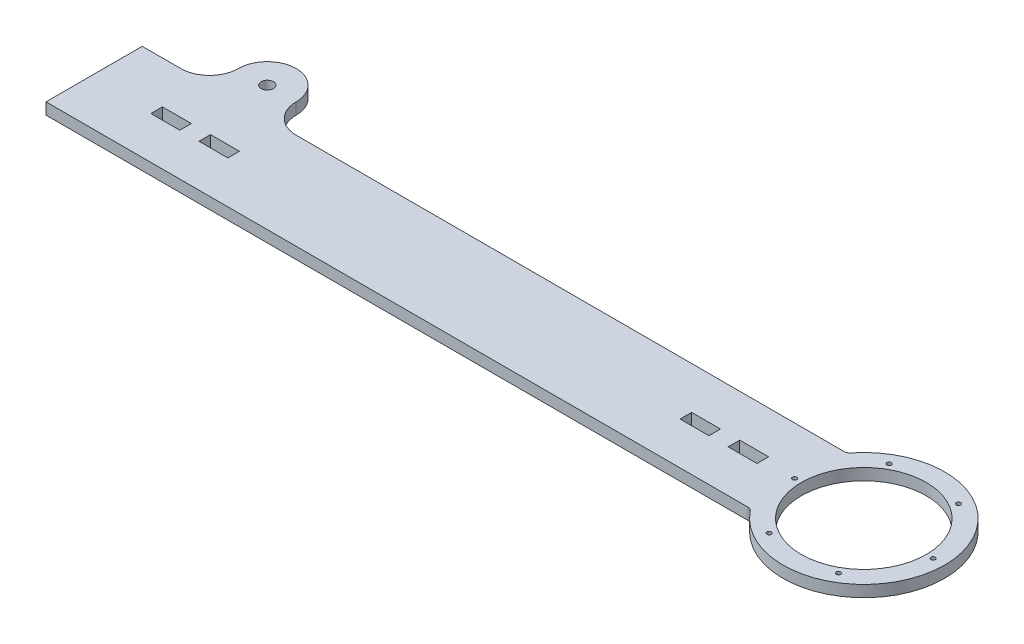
ISO-10303-21;
HEADER;
FILE_DESCRIPTION(('STEP AP214'),'2;1');
FILE_NAME('part.step','',(''),(''),'','','');
FILE_SCHEMA(('AUTOMOTIVE_DESIGN { 1 0 10303 214 1 1 1 1 }'));
ENDSEC;
DATA;
#1=APPLICATION_CONTEXT('core data for automotive mechanical design processes');
#2=APPLICATION_PROTOCOL_DEFINITION('international standard','automotive_design',2000,#1);
#3=PRODUCT_CONTEXT('',#1,'mechanical');
#4=PRODUCT('Part','Part','',(#3));
#5=PRODUCT_RELATED_PRODUCT_CATEGORY('part','',(#4));
#6=PRODUCT_DEFINITION_FORMATION('','',#4);
#7=PRODUCT_DEFINITION_CONTEXT('part definition',#1,'design');
#8=PRODUCT_DEFINITION('design','',#6,#7);
#9=PRODUCT_DEFINITION_SHAPE('','',#8);
#10=(LENGTH_UNIT() NAMED_UNIT(*) SI_UNIT(.MILLI.,.METRE.));
#11=(NAMED_UNIT(*) PLANE_ANGLE_UNIT() SI_UNIT($,.RADIAN.));
#12=(NAMED_UNIT(*) SI_UNIT($,.STERADIAN.) SOLID_ANGLE_UNIT());
#13=UNCERTAINTY_MEASURE_WITH_UNIT(LENGTH_MEASURE(1.E-05),#10,'distance_accuracy_value','');
#14=(GEOMETRIC_REPRESENTATION_CONTEXT(3) GLOBAL_UNCERTAINTY_ASSIGNED_CONTEXT((#13)) GLOBAL_UNIT_ASSIGNED_CONTEXT((#10,
#11,#12)) REPRESENTATION_CONTEXT('',''));
#15=CARTESIAN_POINT('',(0.,0.,0.));
#16=DIRECTION('',(0.,0.,1.));
#17=DIRECTION('',(1.,0.,0.));
#18=AXIS2_PLACEMENT_3D('',#15,#16,#17);
#19=CARTESIAN_POINT('',(-400.,6.,-25.));
#20=DIRECTION('',(0.,0.,1.));
#21=DIRECTION('',(1.,0.,0.));
#22=AXIS2_PLACEMENT_3D('',#19,#20,#21);
#23=PLANE('',#22);
#24=DIRECTION('',(0.,1.,0.));
#25=VECTOR('',#24,1.);
#26=CARTESIAN_POINT('',(-320.,-67.0820393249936,-25.));
#27=LINE('',#26,#25);
#28=CARTESIAN_POINT('',(-320.,0.,-25.));
#29=VERTEX_POINT('',#28);
#30=CARTESIAN_POINT('',(-320.,6.,-25.));
#31=VERTEX_POINT('',#30);
#32=EDGE_CURVE('E64',#29,#31,#27,.T.);
#33=ORIENTED_EDGE('',*,*,#32,.T.);
#34=DIRECTION('',(-1.,0.,0.));
#35=VECTOR('',#34,1.);
#36=CARTESIAN_POINT('',(-400.,6.,-25.));
#37=LINE('',#36,#35);
#38=CARTESIAN_POINT('',(-35.2278299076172,6.,-25.));
#39=VERTEX_POINT('',#38);
#40=EDGE_CURVE('E428',#39,#31,#37,.T.);
#41=ORIENTED_EDGE('',*,*,#40,.F.);
#42=DIRECTION('',(0.,1.,0.));
#43=VECTOR('',#42,1.);
#44=CARTESIAN_POINT('',(-35.2278299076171,0.,-25.));
#45=LINE('',#44,#43);
#46=CARTESIAN_POINT('',(-35.2278299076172,0.,-25.));
#47=VERTEX_POINT('',#46);
#48=EDGE_CURVE('E453',#39,#47,#45,.F.);
#49=ORIENTED_EDGE('',*,*,#48,.T.);
#50=DIRECTION('',(-1.,0.,0.));
#51=VECTOR('',#50,1.);
#52=CARTESIAN_POINT('',(-400.,0.,-25.));
#53=LINE('',#52,#51);
#54=EDGE_CURVE('E438',#47,#29,#53,.T.);
#55=ORIENTED_EDGE('',*,*,#54,.T.);
#56=EDGE_LOOP('',(#33,#41,#49,#55));
#57=FACE_BOUND('',#56,.T.);
#58=ADVANCED_FACE('F41',(#57),#23,.F.);
#59=CARTESIAN_POINT('',(-380.,6.,-25.));
#60=VERTEX_POINT('',#59);
#61=CARTESIAN_POINT('',(-400.,6.,-25.));
#62=VERTEX_POINT('',#61);
#63=EDGE_CURVE('E56',#60,#62,#37,.T.);
#64=ORIENTED_EDGE('',*,*,#63,.F.);
#65=DIRECTION('',(0.,1.,0.));
#66=VECTOR('',#65,1.);
#67=CARTESIAN_POINT('',(-380.,-67.0820393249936,-25.));
#68=LINE('',#67,#66);
#69=CARTESIAN_POINT('',(-380.,0.,-25.));
#70=VERTEX_POINT('',#69);
#71=EDGE_CURVE('E230',#70,#60,#68,.T.);
#72=ORIENTED_EDGE('',*,*,#71,.F.);
#73=CARTESIAN_POINT('',(-400.,0.,-25.));
#74=VERTEX_POINT('',#73);
#75=EDGE_CURVE('E425',#70,#74,#53,.T.);
#76=ORIENTED_EDGE('',*,*,#75,.T.);
#77=DIRECTION('',(0.,-1.,0.));
#78=VECTOR('',#77,1.);
#79=CARTESIAN_POINT('',(-400.,6.,-25.));
#80=LINE('',#79,#78);
#81=EDGE_CURVE('E450',#62,#74,#80,.T.);
#82=ORIENTED_EDGE('',*,*,#81,.F.);
#83=EDGE_LOOP('',(#64,#72,#76,#82));
#84=FACE_BOUND('',#83,.T.);
#85=ADVANCED_FACE('F503',(#84),#23,.F.);
#86=CARTESIAN_POINT('',(-400.,6.,-25.));
#87=DIRECTION('',(1.,0.,0.));
#88=DIRECTION('',(0.,0.,-1.));
#89=AXIS2_PLACEMENT_3D('',#86,#87,#88);
#90=PLANE('',#89);
#91=DIRECTION('',(0.,0.,1.));
#92=VECTOR('',#91,1.);
#93=CARTESIAN_POINT('',(-400.,0.,-25.));
#94=LINE('',#93,#92);
#95=CARTESIAN_POINT('',(-400.,0.,25.));
#96=VERTEX_POINT('',#95);
#97=EDGE_CURVE('E440',#74,#96,#94,.T.);
#98=ORIENTED_EDGE('',*,*,#97,.T.);
#99=DIRECTION('',(0.,-1.,0.));
#100=VECTOR('',#99,1.);
#101=CARTESIAN_POINT('',(-400.,6.,25.));
#102=LINE('',#101,#100);
#103=CARTESIAN_POINT('',(-400.,6.,25.));
#104=VERTEX_POINT('',#103);
#105=EDGE_CURVE('E437',#104,#96,#102,.T.);
#106=ORIENTED_EDGE('',*,*,#105,.F.);
#107=DIRECTION('',(0.,0.,1.));
#108=VECTOR('',#107,1.);
#109=CARTESIAN_POINT('',(-400.,6.,-25.));
#110=LINE('',#109,#108);
#111=EDGE_CURVE('E430',#62,#104,#110,.T.);
#112=ORIENTED_EDGE('',*,*,#111,.F.);
#113=ORIENTED_EDGE('',*,*,#81,.T.);
#114=EDGE_LOOP('',(#98,#106,#112,#113));
#115=FACE_BOUND('',#114,.T.);
#116=ADVANCED_FACE('F509',(#115),#90,.F.);
#117=CARTESIAN_POINT('',(-400.,6.,25.));
#118=DIRECTION('',(0.,0.,-1.));
#119=DIRECTION('',(-1.,0.,0.));
#120=AXIS2_PLACEMENT_3D('',#117,#118,#119);
#121=PLANE('',#120);
#122=DIRECTION('',(1.,0.,0.));
#123=VECTOR('',#122,1.);
#124=CARTESIAN_POINT('',(-400.,0.,25.));
#125=LINE('',#124,#123);
#126=CARTESIAN_POINT('',(-35.2278299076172,0.,25.));
#127=VERTEX_POINT('',#126);
#128=EDGE_CURVE('E442',#96,#127,#125,.T.);
#129=ORIENTED_EDGE('',*,*,#128,.T.);
#130=DIRECTION('',(0.,1.,0.));
#131=VECTOR('',#130,1.);
#132=CARTESIAN_POINT('',(-35.2278299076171,6.,25.));
#133=LINE('',#132,#131);
#134=CARTESIAN_POINT('',(-35.2278299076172,6.,25.));
#135=VERTEX_POINT('',#134);
#136=EDGE_CURVE('E461',#127,#135,#133,.T.);
#137=ORIENTED_EDGE('',*,*,#136,.T.);
#138=DIRECTION('',(1.,0.,0.));
#139=VECTOR('',#138,1.);
#140=CARTESIAN_POINT('',(-400.,6.,25.));
#141=LINE('',#140,#139);
#142=EDGE_CURVE('E432',#104,#135,#141,.T.);
#143=ORIENTED_EDGE('',*,*,#142,.F.);
#144=ORIENTED_EDGE('',*,*,#105,.T.);
#145=EDGE_LOOP('',(#129,#137,#143,#144));
#146=FACE_BOUND('',#145,.T.);
#147=ADVANCED_FACE('F477',(#146),#121,.F.);
#148=CARTESIAN_POINT('',(0.,6.,0.));
#149=DIRECTION('',(0.,-1.,0.));
#150=DIRECTION('',(0.,0.,-1.));
#151=AXIS2_PLACEMENT_3D('',#148,#149,#150);
#152=CYLINDRICAL_SURFACE('',#151,42.);
#153=CARTESIAN_POINT('',(0.,0.,0.));
#154=DIRECTION('',(0.,1.,0.));
#155=DIRECTION('',(0.,0.,-1.));
#156=AXIS2_PLACEMENT_3D('',#153,#154,#155);
#157=CIRCLE('',#156,42.);
#158=CARTESIAN_POINT('',(-32.8793079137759,0.,26.1333333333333));
#159=VERTEX_POINT('',#158);
#160=CARTESIAN_POINT('',(-32.8793079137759,0.,-26.1333333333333));
#161=VERTEX_POINT('',#160);
#162=EDGE_CURVE('E445',#159,#161,#157,.T.);
#163=ORIENTED_EDGE('',*,*,#162,.T.);
#164=DIRECTION('',(0.,-1.,0.));
#165=VECTOR('',#164,1.);
#166=CARTESIAN_POINT('',(-32.8793079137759,6.,-26.1333333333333));
#167=LINE('',#166,#165);
#168=CARTESIAN_POINT('',(-32.8793079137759,6.,-26.1333333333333));
#169=VERTEX_POINT('',#168);
#170=EDGE_CURVE('E459',#161,#169,#167,.F.);
#171=ORIENTED_EDGE('',*,*,#170,.T.);
#172=CARTESIAN_POINT('',(0.,6.,0.));
#173=DIRECTION('',(0.,1.,0.));
#174=DIRECTION('',(0.,0.,-1.));
#175=AXIS2_PLACEMENT_3D('',#172,#173,#174);
#176=CIRCLE('',#175,42.);
#177=CARTESIAN_POINT('',(-32.8793079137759,6.,26.1333333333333));
#178=VERTEX_POINT('',#177);
#179=EDGE_CURVE('E435',#178,#169,#176,.T.);
#180=ORIENTED_EDGE('',*,*,#179,.F.);
#181=DIRECTION('',(0.,-1.,0.));
#182=VECTOR('',#181,1.);
#183=CARTESIAN_POINT('',(-32.8793079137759,6.,26.1333333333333));
#184=LINE('',#183,#182);
#185=EDGE_CURVE('E456',#178,#159,#184,.T.);
#186=ORIENTED_EDGE('',*,*,#185,.T.);
#187=EDGE_LOOP('',(#163,#171,#180,#186));
#188=FACE_BOUND('',#187,.T.);
#189=ADVANCED_FACE('F484',(#188),#152,.T.);
#190=CARTESIAN_POINT('',(0.,6.,0.));
#191=DIRECTION('',(0.,-1.,0.));
#192=DIRECTION('',(0.,0.,-1.));
#193=AXIS2_PLACEMENT_3D('',#190,#191,#192);
#194=PLANE('',#193);
#195=CARTESIAN_POINT('',(18.0000000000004,6.,31.1769145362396));
#196=DIRECTION('',(0.,-1.,0.));
#197=DIRECTION('',(0.,0.,-1.));
#198=AXIS2_PLACEMENT_3D('',#195,#196,#197);
#199=CIRCLE('',#198,1.1303);
#200=CARTESIAN_POINT('',(18.0000000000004,6.,30.0466145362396));
#201=VERTEX_POINT('',#200);
#202=EDGE_CURVE('E284',#201,#201,#199,.F.);
#203=ORIENTED_EDGE('',*,*,#202,.F.);
#204=EDGE_LOOP('',(#203));
#205=FACE_BOUND('',#204,.T.);
#206=CARTESIAN_POINT('',(-17.9999999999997,6.,31.17691453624));
#207=DIRECTION('',(0.,-1.,0.));
#208=DIRECTION('',(0.,0.,-1.));
#209=AXIS2_PLACEMENT_3D('',#206,#207,#208);
#210=CIRCLE('',#209,1.1303);
#211=CARTESIAN_POINT('',(-17.9999999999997,6.,30.04661453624));
#212=VERTEX_POINT('',#211);
#213=EDGE_CURVE('E281',#212,#212,#210,.F.);
#214=ORIENTED_EDGE('',*,*,#213,.F.);
#215=EDGE_LOOP('',(#214));
#216=FACE_BOUND('',#215,.T.);
#217=CARTESIAN_POINT('',(-36.,6.,0.));
#218=DIRECTION('',(0.,-1.,0.));
#219=DIRECTION('',(0.,0.,-1.));
#220=AXIS2_PLACEMENT_3D('',#217,#218,#219);
#221=CIRCLE('',#220,1.1303);
#222=CARTESIAN_POINT('',(-36.,6.,-1.1303));
#223=VERTEX_POINT('',#222);
#224=EDGE_CURVE('E278',#223,#223,#221,.F.);
#225=ORIENTED_EDGE('',*,*,#224,.F.);
#226=EDGE_LOOP('',(#225));
#227=FACE_BOUND('',#226,.T.);
#228=CARTESIAN_POINT('',(-18.0000000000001,6.,-31.1769145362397));
#229=DIRECTION('',(0.,-1.,0.));
#230=DIRECTION('',(0.,0.,-1.));
#231=AXIS2_PLACEMENT_3D('',#228,#229,#230);
#232=CIRCLE('',#231,1.1303);
#233=CARTESIAN_POINT('',(-18.0000000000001,6.,-32.3072145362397));
#234=VERTEX_POINT('',#233);
#235=EDGE_CURVE('E275',#234,#234,#232,.F.);
#236=ORIENTED_EDGE('',*,*,#235,.F.);
#237=EDGE_LOOP('',(#236));
#238=FACE_BOUND('',#237,.T.);
#239=CARTESIAN_POINT('',(17.9999999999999,6.,-31.1769145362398));
#240=DIRECTION('',(0.,-1.,0.));
#241=DIRECTION('',(0.,0.,-1.));
#242=AXIS2_PLACEMENT_3D('',#239,#240,#241);
#243=CIRCLE('',#242,1.1303);
#244=CARTESIAN_POINT('',(17.9999999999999,6.,-32.3072145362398));
#245=VERTEX_POINT('',#244);
#246=EDGE_CURVE('E272',#245,#245,#243,.F.);
#247=ORIENTED_EDGE('',*,*,#246,.F.);
#248=EDGE_LOOP('',(#247));
#249=FACE_BOUND('',#248,.T.);
#250=CARTESIAN_POINT('',(36.,6.,0.));
#251=DIRECTION('',(0.,-1.,0.));
#252=DIRECTION('',(0.,0.,-1.));
#253=AXIS2_PLACEMENT_3D('',#250,#251,#252);
#254=CIRCLE('',#253,1.1303);
#255=CARTESIAN_POINT('',(36.,6.,-1.1303));
#256=VERTEX_POINT('',#255);
#257=EDGE_CURVE('E290',#256,#256,#254,.F.);
#258=ORIENTED_EDGE('',*,*,#257,.F.);
#259=EDGE_LOOP('',(#258));
#260=FACE_BOUND('',#259,.T.);
#261=DIRECTION('',(1.,0.,0.));
#262=VECTOR('',#261,1.);
#263=CARTESIAN_POINT('',(-367.5,6.,3.00000000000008));
#264=LINE('',#263,#262);
#265=CARTESIAN_POINT('',(-367.5,6.,3.00000000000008));
#266=VERTEX_POINT('',#265);
#267=CARTESIAN_POINT('',(-352.5,6.,3.00000000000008));
#268=VERTEX_POINT('',#267);
#269=EDGE_CURVE('E370',#266,#268,#264,.T.);
#270=ORIENTED_EDGE('',*,*,#269,.F.);
#271=DIRECTION('',(0.,0.,1.));
#272=VECTOR('',#271,1.);
#273=CARTESIAN_POINT('',(-367.5,6.,-2.99999999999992));
#274=LINE('',#273,#272);
#275=CARTESIAN_POINT('',(-367.5,6.,-2.99999999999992));
#276=VERTEX_POINT('',#275);
#277=EDGE_CURVE('E368',#276,#266,#274,.T.);
#278=ORIENTED_EDGE('',*,*,#277,.F.);
#279=DIRECTION('',(-1.,0.,0.));
#280=VECTOR('',#279,1.);
#281=CARTESIAN_POINT('',(-352.5,6.,-2.99999999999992));
#282=LINE('',#281,#280);
#283=CARTESIAN_POINT('',(-352.5,6.,-2.99999999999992));
#284=VERTEX_POINT('',#283);
#285=EDGE_CURVE('E376',#284,#276,#282,.T.);
#286=ORIENTED_EDGE('',*,*,#285,.F.);
#287=DIRECTION('',(0.,0.,-1.));
#288=VECTOR('',#287,1.);
#289=CARTESIAN_POINT('',(-352.5,6.,3.00000000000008));
#290=LINE('',#289,#288);
#291=EDGE_CURVE('E373',#268,#284,#290,.T.);
#292=ORIENTED_EDGE('',*,*,#291,.F.);
#293=EDGE_LOOP('',(#270,#278,#286,#292));
#294=FACE_BOUND('',#293,.T.);
#295=DIRECTION('',(1.,0.,0.));
#296=VECTOR('',#295,1.);
#297=CARTESIAN_POINT('',(-342.5,6.,3.00000000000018));
#298=LINE('',#297,#296);
#299=CARTESIAN_POINT('',(-342.5,6.,3.00000000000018));
#300=VERTEX_POINT('',#299);
#301=CARTESIAN_POINT('',(-327.5,6.,3.00000000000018));
#302=VERTEX_POINT('',#301);
#303=EDGE_CURVE('E340',#300,#302,#298,.T.);
#304=ORIENTED_EDGE('',*,*,#303,.F.);
#305=DIRECTION('',(0.,0.,1.));
#306=VECTOR('',#305,1.);
#307=CARTESIAN_POINT('',(-342.5,6.,-2.99999999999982));
#308=LINE('',#307,#306);
#309=CARTESIAN_POINT('',(-342.5,6.,-2.99999999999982));
#310=VERTEX_POINT('',#309);
#311=EDGE_CURVE('E338',#310,#300,#308,.T.);
#312=ORIENTED_EDGE('',*,*,#311,.F.);
#313=DIRECTION('',(-1.,0.,0.));
#314=VECTOR('',#313,1.);
#315=CARTESIAN_POINT('',(-327.5,6.,-2.99999999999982));
#316=LINE('',#315,#314);
#317=CARTESIAN_POINT('',(-327.5,6.,-2.99999999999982));
#318=VERTEX_POINT('',#317);
#319=EDGE_CURVE('E346',#318,#310,#316,.T.);
#320=ORIENTED_EDGE('',*,*,#319,.F.);
#321=DIRECTION('',(0.,0.,-1.));
#322=VECTOR('',#321,1.);
#323=CARTESIAN_POINT('',(-327.5,6.,3.00000000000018));
#324=LINE('',#323,#322);
#325=EDGE_CURVE('E343',#302,#318,#324,.T.);
#326=ORIENTED_EDGE('',*,*,#325,.F.);
#327=EDGE_LOOP('',(#304,#312,#320,#326));
#328=FACE_BOUND('',#327,.T.);
#329=DIRECTION('',(1.,0.,0.));
#330=VECTOR('',#329,1.);
#331=CARTESIAN_POINT('',(-67.5,6.,3.));
#332=LINE('',#331,#330);
#333=CARTESIAN_POINT('',(-67.5,6.,3.));
#334=VERTEX_POINT('',#333);
#335=CARTESIAN_POINT('',(-52.5,6.,3.));
#336=VERTEX_POINT('',#335);
#337=EDGE_CURVE('E306',#334,#336,#332,.T.);
#338=ORIENTED_EDGE('',*,*,#337,.F.);
#339=DIRECTION('',(0.,0.,1.));
#340=VECTOR('',#339,1.);
#341=CARTESIAN_POINT('',(-67.5,6.,-3.));
#342=LINE('',#341,#340);
#343=CARTESIAN_POINT('',(-67.5,6.,-3.));
#344=VERTEX_POINT('',#343);
#345=EDGE_CURVE('E304',#344,#334,#342,.T.);
#346=ORIENTED_EDGE('',*,*,#345,.F.);
#347=DIRECTION('',(-1.,0.,0.));
#348=VECTOR('',#347,1.);
#349=CARTESIAN_POINT('',(-52.5,6.,-3.));
#350=LINE('',#349,#348);
#351=CARTESIAN_POINT('',(-52.5,6.,-3.));
#352=VERTEX_POINT('',#351);
#353=EDGE_CURVE('E312',#352,#344,#350,.T.);
#354=ORIENTED_EDGE('',*,*,#353,.F.);
#355=DIRECTION('',(0.,0.,-1.));
#356=VECTOR('',#355,1.);
#357=CARTESIAN_POINT('',(-52.5,6.,3.));
#358=LINE('',#357,#356);
#359=EDGE_CURVE('E309',#336,#352,#358,.T.);
#360=ORIENTED_EDGE('',*,*,#359,.F.);
#361=EDGE_LOOP('',(#338,#346,#354,#360));
#362=FACE_BOUND('',#361,.T.);
#363=DIRECTION('',(1.,0.,0.));
#364=VECTOR('',#363,1.);
#365=CARTESIAN_POINT('',(-92.5,6.,2.99999999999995));
#366=LINE('',#365,#364);
#367=CARTESIAN_POINT('',(-92.5,6.,2.99999999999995));
#368=VERTEX_POINT('',#367);
#369=CARTESIAN_POINT('',(-77.5,6.,2.99999999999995));
#370=VERTEX_POINT('',#369);
#371=EDGE_CURVE('E400',#368,#370,#366,.T.);
#372=ORIENTED_EDGE('',*,*,#371,.F.);
#373=DIRECTION('',(0.,0.,1.));
#374=VECTOR('',#373,1.);
#375=CARTESIAN_POINT('',(-92.5,6.,-3.00000000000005));
#376=LINE('',#375,#374);
#377=CARTESIAN_POINT('',(-92.5,6.,-3.00000000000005));
#378=VERTEX_POINT('',#377);
#379=EDGE_CURVE('E398',#378,#368,#376,.T.);
#380=ORIENTED_EDGE('',*,*,#379,.F.);
#381=DIRECTION('',(-1.,0.,0.));
#382=VECTOR('',#381,1.);
#383=CARTESIAN_POINT('',(-77.5,6.,-3.00000000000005));
#384=LINE('',#383,#382);
#385=CARTESIAN_POINT('',(-77.5,6.,-3.00000000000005));
#386=VERTEX_POINT('',#385);
#387=EDGE_CURVE('E406',#386,#378,#384,.T.);
#388=ORIENTED_EDGE('',*,*,#387,.F.);
#389=DIRECTION('',(0.,0.,-1.));
#390=VECTOR('',#389,1.);
#391=CARTESIAN_POINT('',(-77.5,6.,2.99999999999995));
#392=LINE('',#391,#390);
#393=EDGE_CURVE('E403',#370,#386,#392,.T.);
#394=ORIENTED_EDGE('',*,*,#393,.F.);
#395=EDGE_LOOP('',(#372,#380,#388,#394));
#396=FACE_BOUND('',#395,.T.);
#397=CARTESIAN_POINT('',(0.,6.,0.));
#398=DIRECTION('',(0.,1.,0.));
#399=DIRECTION('',(0.,0.,1.));
#400=AXIS2_PLACEMENT_3D('',#397,#398,#399);
#401=CIRCLE('',#400,32.45);
#402=CARTESIAN_POINT('',(0.,6.,32.45));
#403=VERTEX_POINT('',#402);
#404=EDGE_CURVE('E421',#403,#403,#401,.T.);
#405=ORIENTED_EDGE('',*,*,#404,.F.);
#406=EDGE_LOOP('',(#405));
#407=FACE_BOUND('',#406,.T.);
#408=ORIENTED_EDGE('',*,*,#179,.T.);
#409=CARTESIAN_POINT('',(-35.2278299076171,6.,-28.));
#410=DIRECTION('',(0.,-1.,0.));
#411=DIRECTION('',(0.,0.,-1.));
#412=AXIS2_PLACEMENT_3D('',#409,#410,#411);
#413=CIRCLE('',#412,3.);
#414=EDGE_CURVE('E465',#169,#39,#413,.T.);
#415=ORIENTED_EDGE('',*,*,#414,.T.);
#416=ORIENTED_EDGE('',*,*,#40,.T.);
#417=CARTESIAN_POINT('',(-320.,6.,-40.));
#418=DIRECTION('',(0.,-1.,0.));
#419=DIRECTION('',(0.,0.,1.));
#420=AXIS2_PLACEMENT_3D('',#417,#418,#419);
#421=CIRCLE('',#420,15.);
#422=CARTESIAN_POINT('',(-335.,6.,-40.));
#423=VERTEX_POINT('',#422);
#424=EDGE_CURVE('E232',#31,#423,#421,.T.);
#425=ORIENTED_EDGE('',*,*,#424,.T.);
#426=CARTESIAN_POINT('',(-350.,6.,-40.));
#427=DIRECTION('',(0.,1.,0.));
#428=DIRECTION('',(0.,0.,-1.));
#429=AXIS2_PLACEMENT_3D('',#426,#427,#428);
#430=CIRCLE('',#429,15.);
#431=CARTESIAN_POINT('',(-365.,6.,-40.));
#432=VERTEX_POINT('',#431);
#433=EDGE_CURVE('E221',#423,#432,#430,.T.);
#434=ORIENTED_EDGE('',*,*,#433,.T.);
#435=CARTESIAN_POINT('',(-380.,6.,-40.));
#436=DIRECTION('',(0.,-1.,0.));
#437=DIRECTION('',(0.,0.,-1.));
#438=AXIS2_PLACEMENT_3D('',#435,#436,#437);
#439=CIRCLE('',#438,15.);
#440=EDGE_CURVE('E228',#432,#60,#439,.T.);
#441=ORIENTED_EDGE('',*,*,#440,.T.);
#442=ORIENTED_EDGE('',*,*,#63,.T.);
#443=ORIENTED_EDGE('',*,*,#111,.T.);
#444=ORIENTED_EDGE('',*,*,#142,.T.);
#445=CARTESIAN_POINT('',(-35.2278299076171,6.,28.));
#446=DIRECTION('',(0.,-1.,0.));
#447=DIRECTION('',(0.,0.,-1.));
#448=AXIS2_PLACEMENT_3D('',#445,#446,#447);
#449=CIRCLE('',#448,3.);
#450=EDGE_CURVE('E11',#135,#178,#449,.T.);
#451=ORIENTED_EDGE('',*,*,#450,.T.);
#452=EDGE_LOOP('',(#408,#415,#416,#425,#434,#441,#442,#443,#444,#451));
#453=FACE_BOUND('',#452,.T.);
#454=CARTESIAN_POINT('',(-350.,6.,-40.));
#455=DIRECTION('',(0.,1.,0.));
#456=DIRECTION('',(0.,0.,1.));
#457=AXIS2_PLACEMENT_3D('',#454,#455,#456);
#458=CIRCLE('',#457,3.17499999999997);
#459=CARTESIAN_POINT('',(-350.,6.,-36.825));
#460=VERTEX_POINT('',#459);
#461=EDGE_CURVE('E233',#460,#460,#458,.T.);
#462=ORIENTED_EDGE('',*,*,#461,.F.);
#463=EDGE_LOOP('',(#462));
#464=FACE_BOUND('',#463,.T.);
#465=ADVANCED_FACE('F237',(#205,#216,#227,#238,#249,#260,#294,#328,#362,#396,#407,#453,#464),
#194,.F.);
#466=CARTESIAN_POINT('',(0.,0.,0.));
#467=DIRECTION('',(0.,-1.,0.));
#468=DIRECTION('',(0.,0.,-1.));
#469=AXIS2_PLACEMENT_3D('',#466,#467,#468);
#470=PLANE('',#469);
#471=CARTESIAN_POINT('',(18.0000000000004,0.,31.1769145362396));
#472=DIRECTION('',(0.,-1.,0.));
#473=DIRECTION('',(0.,0.,-1.));
#474=AXIS2_PLACEMENT_3D('',#471,#472,#473);
#475=CIRCLE('',#474,1.1303);
#476=CARTESIAN_POINT('',(18.0000000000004,0.,30.0466145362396));
#477=VERTEX_POINT('',#476);
#478=EDGE_CURVE('E243',#477,#477,#475,.F.);
#479=ORIENTED_EDGE('',*,*,#478,.T.);
#480=EDGE_LOOP('',(#479));
#481=FACE_BOUND('',#480,.T.);
#482=CARTESIAN_POINT('',(-17.9999999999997,0.,31.17691453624));
#483=DIRECTION('',(0.,-1.,0.));
#484=DIRECTION('',(0.,0.,-1.));
#485=AXIS2_PLACEMENT_3D('',#482,#483,#484);
#486=CIRCLE('',#485,1.1303);
#487=CARTESIAN_POINT('',(-17.9999999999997,0.,30.04661453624));
#488=VERTEX_POINT('',#487);
#489=EDGE_CURVE('E265',#488,#488,#486,.F.);
#490=ORIENTED_EDGE('',*,*,#489,.T.);
#491=EDGE_LOOP('',(#490));
#492=FACE_BOUND('',#491,.T.);
#493=CARTESIAN_POINT('',(-36.,0.,0.));
#494=DIRECTION('',(0.,-1.,0.));
#495=DIRECTION('',(0.,0.,-1.));
#496=AXIS2_PLACEMENT_3D('',#493,#494,#495);
#497=CIRCLE('',#496,1.1303);
#498=CARTESIAN_POINT('',(-36.,0.,-1.1303));
#499=VERTEX_POINT('',#498);
#500=EDGE_CURVE('E262',#499,#499,#497,.F.);
#501=ORIENTED_EDGE('',*,*,#500,.T.);
#502=EDGE_LOOP('',(#501));
#503=FACE_BOUND('',#502,.T.);
#504=CARTESIAN_POINT('',(-18.0000000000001,0.,-31.1769145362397));
#505=DIRECTION('',(0.,-1.,0.));
#506=DIRECTION('',(0.,0.,-1.));
#507=AXIS2_PLACEMENT_3D('',#504,#505,#506);
#508=CIRCLE('',#507,1.1303);
#509=CARTESIAN_POINT('',(-18.0000000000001,0.,-32.3072145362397));
#510=VERTEX_POINT('',#509);
#511=EDGE_CURVE('E258',#510,#510,#508,.F.);
#512=ORIENTED_EDGE('',*,*,#511,.T.);
#513=EDGE_LOOP('',(#512));
#514=FACE_BOUND('',#513,.T.);
#515=CARTESIAN_POINT('',(17.9999999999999,0.,-31.1769145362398));
#516=DIRECTION('',(0.,-1.,0.));
#517=DIRECTION('',(0.,0.,-1.));
#518=AXIS2_PLACEMENT_3D('',#515,#516,#517);
#519=CIRCLE('',#518,1.1303);
#520=CARTESIAN_POINT('',(17.9999999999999,0.,-32.3072145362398));
#521=VERTEX_POINT('',#520);
#522=EDGE_CURVE('E261',#521,#521,#519,.F.);
#523=ORIENTED_EDGE('',*,*,#522,.T.);
#524=EDGE_LOOP('',(#523));
#525=FACE_BOUND('',#524,.T.);
#526=CARTESIAN_POINT('',(36.,0.,0.));
#527=DIRECTION('',(0.,-1.,0.));
#528=DIRECTION('',(0.,0.,-1.));
#529=AXIS2_PLACEMENT_3D('',#526,#527,#528);
#530=CIRCLE('',#529,1.1303);
#531=CARTESIAN_POINT('',(36.,0.,-1.1303));
#532=VERTEX_POINT('',#531);
#533=EDGE_CURVE('E287',#532,#532,#530,.F.);
#534=ORIENTED_EDGE('',*,*,#533,.T.);
#535=EDGE_LOOP('',(#534));
#536=FACE_BOUND('',#535,.T.);
#537=DIRECTION('',(0.,0.,1.));
#538=VECTOR('',#537,1.);
#539=CARTESIAN_POINT('',(-367.5,0.,-2.99999999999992));
#540=LINE('',#539,#538);
#541=CARTESIAN_POINT('',(-367.5,0.,-2.99999999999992));
#542=VERTEX_POINT('',#541);
#543=CARTESIAN_POINT('',(-367.5,0.,3.00000000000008));
#544=VERTEX_POINT('',#543);
#545=EDGE_CURVE('E365',#542,#544,#540,.T.);
#546=ORIENTED_EDGE('',*,*,#545,.T.);
#547=DIRECTION('',(1.,0.,0.));
#548=VECTOR('',#547,1.);
#549=CARTESIAN_POINT('',(-367.5,0.,3.00000000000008));
#550=LINE('',#549,#548);
#551=CARTESIAN_POINT('',(-352.5,0.,3.00000000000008));
#552=VERTEX_POINT('',#551);
#553=EDGE_CURVE('E332',#544,#552,#550,.T.);
#554=ORIENTED_EDGE('',*,*,#553,.T.);
#555=DIRECTION('',(0.,0.,-1.));
#556=VECTOR('',#555,1.);
#557=CARTESIAN_POINT('',(-352.5,0.,3.00000000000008));
#558=LINE('',#557,#556);
#559=CARTESIAN_POINT('',(-352.5,0.,-2.99999999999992));
#560=VERTEX_POINT('',#559);
#561=EDGE_CURVE('E293',#552,#560,#558,.T.);
#562=ORIENTED_EDGE('',*,*,#561,.T.);
#563=DIRECTION('',(-1.,0.,0.));
#564=VECTOR('',#563,1.);
#565=CARTESIAN_POINT('',(-352.5,0.,-2.99999999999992));
#566=LINE('',#565,#564);
#567=EDGE_CURVE('E362',#560,#542,#566,.T.);
#568=ORIENTED_EDGE('',*,*,#567,.T.);
#569=EDGE_LOOP('',(#546,#554,#562,#568));
#570=FACE_BOUND('',#569,.T.);
#571=DIRECTION('',(0.,0.,1.));
#572=VECTOR('',#571,1.);
#573=CARTESIAN_POINT('',(-342.5,0.,-2.99999999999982));
#574=LINE('',#573,#572);
#575=CARTESIAN_POINT('',(-342.5,0.,-2.99999999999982));
#576=VERTEX_POINT('',#575);
#577=CARTESIAN_POINT('',(-342.5,0.,3.00000000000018));
#578=VERTEX_POINT('',#577);
#579=EDGE_CURVE('E335',#576,#578,#574,.T.);
#580=ORIENTED_EDGE('',*,*,#579,.T.);
#581=DIRECTION('',(1.,0.,0.));
#582=VECTOR('',#581,1.);
#583=CARTESIAN_POINT('',(-342.5,0.,3.00000000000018));
#584=LINE('',#583,#582);
#585=CARTESIAN_POINT('',(-327.5,0.,3.00000000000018));
#586=VERTEX_POINT('',#585);
#587=EDGE_CURVE('E298',#578,#586,#584,.T.);
#588=ORIENTED_EDGE('',*,*,#587,.T.);
#589=DIRECTION('',(0.,0.,-1.));
#590=VECTOR('',#589,1.);
#591=CARTESIAN_POINT('',(-327.5,0.,3.00000000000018));
#592=LINE('',#591,#590);
#593=CARTESIAN_POINT('',(-327.5,0.,-2.99999999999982));
#594=VERTEX_POINT('',#593);
#595=EDGE_CURVE('E328',#586,#594,#592,.T.);
#596=ORIENTED_EDGE('',*,*,#595,.T.);
#597=DIRECTION('',(-1.,0.,0.));
#598=VECTOR('',#597,1.);
#599=CARTESIAN_POINT('',(-327.5,0.,-2.99999999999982));
#600=LINE('',#599,#598);
#601=EDGE_CURVE('E331',#594,#576,#600,.T.);
#602=ORIENTED_EDGE('',*,*,#601,.T.);
#603=EDGE_LOOP('',(#580,#588,#596,#602));
#604=FACE_BOUND('',#603,.T.);
#605=DIRECTION('',(0.,0.,1.));
#606=VECTOR('',#605,1.);
#607=CARTESIAN_POINT('',(-67.5,0.,-3.));
#608=LINE('',#607,#606);
#609=CARTESIAN_POINT('',(-67.5,0.,-3.));
#610=VERTEX_POINT('',#609);
#611=CARTESIAN_POINT('',(-67.5,0.,3.));
#612=VERTEX_POINT('',#611);
#613=EDGE_CURVE('E301',#610,#612,#608,.T.);
#614=ORIENTED_EDGE('',*,*,#613,.T.);
#615=DIRECTION('',(1.,0.,0.));
#616=VECTOR('',#615,1.);
#617=CARTESIAN_POINT('',(-67.5,0.,3.));
#618=LINE('',#617,#616);
#619=CARTESIAN_POINT('',(-52.5,0.,3.));
#620=VERTEX_POINT('',#619);
#621=EDGE_CURVE('E318',#612,#620,#618,.T.);
#622=ORIENTED_EDGE('',*,*,#621,.T.);
#623=DIRECTION('',(0.,0.,-1.));
#624=VECTOR('',#623,1.);
#625=CARTESIAN_POINT('',(-52.5,0.,3.));
#626=LINE('',#625,#624);
#627=CARTESIAN_POINT('',(-52.5,0.,-3.));
#628=VERTEX_POINT('',#627);
#629=EDGE_CURVE('E294',#620,#628,#626,.T.);
#630=ORIENTED_EDGE('',*,*,#629,.T.);
#631=DIRECTION('',(-1.,0.,0.));
#632=VECTOR('',#631,1.);
#633=CARTESIAN_POINT('',(-52.5,0.,-3.));
#634=LINE('',#633,#632);
#635=EDGE_CURVE('E297',#628,#610,#634,.T.);
#636=ORIENTED_EDGE('',*,*,#635,.T.);
#637=EDGE_LOOP('',(#614,#622,#630,#636));
#638=FACE_BOUND('',#637,.T.);
#639=DIRECTION('',(0.,0.,1.));
#640=VECTOR('',#639,1.);
#641=CARTESIAN_POINT('',(-92.5,0.,-3.00000000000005));
#642=LINE('',#641,#640);
#643=CARTESIAN_POINT('',(-92.5,0.,-3.00000000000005));
#644=VERTEX_POINT('',#643);
#645=CARTESIAN_POINT('',(-92.5,0.,2.99999999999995));
#646=VERTEX_POINT('',#645);
#647=EDGE_CURVE('E395',#644,#646,#642,.T.);
#648=ORIENTED_EDGE('',*,*,#647,.T.);
#649=DIRECTION('',(1.,0.,0.));
#650=VECTOR('',#649,1.);
#651=CARTESIAN_POINT('',(-92.5,0.,2.99999999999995));
#652=LINE('',#651,#650);
#653=CARTESIAN_POINT('',(-77.5,0.,2.99999999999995));
#654=VERTEX_POINT('',#653);
#655=EDGE_CURVE('E412',#646,#654,#652,.T.);
#656=ORIENTED_EDGE('',*,*,#655,.T.);
#657=DIRECTION('',(0.,0.,-1.));
#658=VECTOR('',#657,1.);
#659=CARTESIAN_POINT('',(-77.5,0.,2.99999999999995));
#660=LINE('',#659,#658);
#661=CARTESIAN_POINT('',(-77.5,0.,-3.00000000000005));
#662=VERTEX_POINT('',#661);
#663=EDGE_CURVE('E327',#654,#662,#660,.T.);
#664=ORIENTED_EDGE('',*,*,#663,.T.);
#665=DIRECTION('',(-1.,0.,0.));
#666=VECTOR('',#665,1.);
#667=CARTESIAN_POINT('',(-77.5,0.,-3.00000000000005));
#668=LINE('',#667,#666);
#669=EDGE_CURVE('E392',#662,#644,#668,.T.);
#670=ORIENTED_EDGE('',*,*,#669,.T.);
#671=EDGE_LOOP('',(#648,#656,#664,#670));
#672=FACE_BOUND('',#671,.T.);
#673=CARTESIAN_POINT('',(0.,0.,0.));
#674=DIRECTION('',(0.,1.,0.));
#675=DIRECTION('',(0.,0.,1.));
#676=AXIS2_PLACEMENT_3D('',#673,#674,#675);
#677=CIRCLE('',#676,32.45);
#678=CARTESIAN_POINT('',(0.,0.,32.45));
#679=VERTEX_POINT('',#678);
#680=EDGE_CURVE('E422',#679,#679,#677,.T.);
#681=ORIENTED_EDGE('',*,*,#680,.T.);
#682=EDGE_LOOP('',(#681));
#683=FACE_BOUND('',#682,.T.);
#684=ORIENTED_EDGE('',*,*,#54,.F.);
#685=CARTESIAN_POINT('',(-35.2278299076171,0.,-28.));
#686=DIRECTION('',(0.,-1.,0.));
#687=DIRECTION('',(0.,0.,-1.));
#688=AXIS2_PLACEMENT_3D('',#685,#686,#687);
#689=CIRCLE('',#688,3.);
#690=EDGE_CURVE('E463',#47,#161,#689,.F.);
#691=ORIENTED_EDGE('',*,*,#690,.T.);
#692=ORIENTED_EDGE('',*,*,#162,.F.);
#693=CARTESIAN_POINT('',(-35.2278299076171,0.,28.));
#694=DIRECTION('',(0.,-1.,0.));
#695=DIRECTION('',(0.,0.,-1.));
#696=AXIS2_PLACEMENT_3D('',#693,#694,#695);
#697=CIRCLE('',#696,3.);
#698=EDGE_CURVE('E49',#159,#127,#697,.F.);
#699=ORIENTED_EDGE('',*,*,#698,.T.);
#700=ORIENTED_EDGE('',*,*,#128,.F.);
#701=ORIENTED_EDGE('',*,*,#97,.F.);
#702=ORIENTED_EDGE('',*,*,#75,.F.);
#703=CARTESIAN_POINT('',(-380.,0.,-40.));
#704=DIRECTION('',(0.,-1.,0.));
#705=DIRECTION('',(0.,0.,-1.));
#706=AXIS2_PLACEMENT_3D('',#703,#704,#705);
#707=CIRCLE('',#706,15.);
#708=CARTESIAN_POINT('',(-365.,0.,-40.));
#709=VERTEX_POINT('',#708);
#710=EDGE_CURVE('E249',#709,#70,#707,.T.);
#711=ORIENTED_EDGE('',*,*,#710,.F.);
#712=CARTESIAN_POINT('',(-350.,0.,-40.));
#713=DIRECTION('',(0.,-1.,0.));
#714=DIRECTION('',(0.,0.,-1.));
#715=AXIS2_PLACEMENT_3D('',#712,#713,#714);
#716=CIRCLE('',#715,15.);
#717=CARTESIAN_POINT('',(-335.,0.,-40.));
#718=VERTEX_POINT('',#717);
#719=EDGE_CURVE('E222',#718,#709,#716,.F.);
#720=ORIENTED_EDGE('',*,*,#719,.F.);
#721=CARTESIAN_POINT('',(-320.,0.,-40.));
#722=DIRECTION('',(0.,-1.,0.));
#723=DIRECTION('',(0.,0.,-1.));
#724=AXIS2_PLACEMENT_3D('',#721,#722,#723);
#725=CIRCLE('',#724,15.);
#726=EDGE_CURVE('E225',#29,#718,#725,.T.);
#727=ORIENTED_EDGE('',*,*,#726,.F.);
#728=EDGE_LOOP('',(#684,#691,#692,#699,#700,#701,#702,#711,#720,#727));
#729=FACE_BOUND('',#728,.T.);
#730=CARTESIAN_POINT('',(-350.,0.,-40.));
#731=DIRECTION('',(0.,-1.,0.));
#732=DIRECTION('',(0.,0.,-1.));
#733=AXIS2_PLACEMENT_3D('',#730,#731,#732);
#734=CIRCLE('',#733,3.17499999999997);
#735=CARTESIAN_POINT('',(-350.,0.,-43.1749999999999));
#736=VERTEX_POINT('',#735);
#737=EDGE_CURVE('E240',#736,#736,#734,.F.);
#738=ORIENTED_EDGE('',*,*,#737,.T.);
#739=EDGE_LOOP('',(#738));
#740=FACE_BOUND('',#739,.T.);
#741=ADVANCED_FACE('F470',(#481,#492,#503,#514,#525,#536,#570,#604,#638,#672,#683,#729,#740),
#470,.T.);
#742=CARTESIAN_POINT('',(0.,0.,0.));
#743=DIRECTION('',(0.,1.,0.));
#744=DIRECTION('',(0.,0.,1.));
#745=AXIS2_PLACEMENT_3D('',#742,#743,#744);
#746=CYLINDRICAL_SURFACE('',#745,32.45);
#747=ORIENTED_EDGE('',*,*,#680,.F.);
#748=EDGE_LOOP('',(#747));
#749=FACE_BOUND('',#748,.T.);
#750=ORIENTED_EDGE('',*,*,#404,.T.);
#751=EDGE_LOOP('',(#750));
#752=FACE_BOUND('',#751,.T.);
#753=ADVANCED_FACE('F604',(#749,#752),#746,.F.);
#754=CARTESIAN_POINT('',(-92.5,-0.00100000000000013,-3.00000000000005));
#755=DIRECTION('',(-1.,0.,0.));
#756=DIRECTION('',(0.,0.,1.));
#757=AXIS2_PLACEMENT_3D('',#754,#755,#756);
#758=PLANE('',#757);
#759=DIRECTION('',(0.,1.,0.));
#760=VECTOR('',#759,1.);
#761=CARTESIAN_POINT('',(-92.5,-0.00100000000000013,-3.00000000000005));
#762=LINE('',#761,#760);
#763=EDGE_CURVE('E410',#644,#378,#762,.T.);
#764=ORIENTED_EDGE('',*,*,#763,.T.);
#765=ORIENTED_EDGE('',*,*,#379,.T.);
#766=DIRECTION('',(0.,1.,0.));
#767=VECTOR('',#766,1.);
#768=CARTESIAN_POINT('',(-92.5,-0.00100000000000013,2.99999999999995));
#769=LINE('',#768,#767);
#770=EDGE_CURVE('E409',#646,#368,#769,.T.);
#771=ORIENTED_EDGE('',*,*,#770,.F.);
#772=ORIENTED_EDGE('',*,*,#647,.F.);
#773=EDGE_LOOP('',(#764,#765,#771,#772));
#774=FACE_BOUND('',#773,.T.);
#775=ADVANCED_FACE('F594',(#774),#758,.F.);
#776=CARTESIAN_POINT('',(-77.5,-0.00100000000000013,-3.00000000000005));
#777=DIRECTION('',(0.,0.,-1.));
#778=DIRECTION('',(-1.,0.,0.));
#779=AXIS2_PLACEMENT_3D('',#776,#777,#778);
#780=PLANE('',#779);
#781=DIRECTION('',(0.,1.,0.));
#782=VECTOR('',#781,1.);
#783=CARTESIAN_POINT('',(-77.5,-0.00100000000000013,-3.00000000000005));
#784=LINE('',#783,#782);
#785=EDGE_CURVE('E413',#662,#386,#784,.T.);
#786=ORIENTED_EDGE('',*,*,#785,.T.);
#787=ORIENTED_EDGE('',*,*,#387,.T.);
#788=ORIENTED_EDGE('',*,*,#763,.F.);
#789=ORIENTED_EDGE('',*,*,#669,.F.);
#790=EDGE_LOOP('',(#786,#787,#788,#789));
#791=FACE_BOUND('',#790,.T.);
#792=ADVANCED_FACE('F590',(#791),#780,.F.);
#793=CARTESIAN_POINT('',(-77.5,-0.00100000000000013,2.99999999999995));
#794=DIRECTION('',(1.,0.,0.));
#795=DIRECTION('',(0.,0.,-1.));
#796=AXIS2_PLACEMENT_3D('',#793,#794,#795);
#797=PLANE('',#796);
#798=DIRECTION('',(0.,1.,0.));
#799=VECTOR('',#798,1.);
#800=CARTESIAN_POINT('',(-77.5,-0.00100000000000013,2.99999999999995));
#801=LINE('',#800,#799);
#802=EDGE_CURVE('E415',#654,#370,#801,.T.);
#803=ORIENTED_EDGE('',*,*,#802,.T.);
#804=ORIENTED_EDGE('',*,*,#393,.T.);
#805=ORIENTED_EDGE('',*,*,#785,.F.);
#806=ORIENTED_EDGE('',*,*,#663,.F.);
#807=EDGE_LOOP('',(#803,#804,#805,#806));
#808=FACE_BOUND('',#807,.T.);
#809=ADVANCED_FACE('F593',(#808),#797,.F.);
#810=CARTESIAN_POINT('',(-92.5,-0.00100000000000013,2.99999999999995));
#811=DIRECTION('',(0.,0.,1.));
#812=DIRECTION('',(1.,0.,0.));
#813=AXIS2_PLACEMENT_3D('',#810,#811,#812);
#814=PLANE('',#813);
#815=ORIENTED_EDGE('',*,*,#770,.T.);
#816=ORIENTED_EDGE('',*,*,#371,.T.);
#817=ORIENTED_EDGE('',*,*,#802,.F.);
#818=ORIENTED_EDGE('',*,*,#655,.F.);
#819=EDGE_LOOP('',(#815,#816,#817,#818));
#820=FACE_BOUND('',#819,.T.);
#821=ADVANCED_FACE('F558',(#820),#814,.F.);
#822=CARTESIAN_POINT('',(-67.5,-0.00100000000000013,-3.));
#823=DIRECTION('',(-1.,0.,0.));
#824=DIRECTION('',(0.,0.,1.));
#825=AXIS2_PLACEMENT_3D('',#822,#823,#824);
#826=PLANE('',#825);
#827=DIRECTION('',(0.,1.,0.));
#828=VECTOR('',#827,1.);
#829=CARTESIAN_POINT('',(-67.5,-0.00100000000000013,-3.));
#830=LINE('',#829,#828);
#831=EDGE_CURVE('E316',#610,#344,#830,.T.);
#832=ORIENTED_EDGE('',*,*,#831,.T.);
#833=ORIENTED_EDGE('',*,*,#345,.T.);
#834=DIRECTION('',(0.,1.,0.));
#835=VECTOR('',#834,1.);
#836=CARTESIAN_POINT('',(-67.5,-0.00100000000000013,3.));
#837=LINE('',#836,#835);
#838=EDGE_CURVE('E315',#612,#334,#837,.T.);
#839=ORIENTED_EDGE('',*,*,#838,.F.);
#840=ORIENTED_EDGE('',*,*,#613,.F.);
#841=EDGE_LOOP('',(#832,#833,#839,#840));
#842=FACE_BOUND('',#841,.T.);
#843=ADVANCED_FACE('F546',(#842),#826,.F.);
#844=CARTESIAN_POINT('',(-52.5,-0.00100000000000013,-3.));
#845=DIRECTION('',(0.,0.,-1.));
#846=DIRECTION('',(-1.,0.,0.));
#847=AXIS2_PLACEMENT_3D('',#844,#845,#846);
#848=PLANE('',#847);
#849=DIRECTION('',(0.,1.,0.));
#850=VECTOR('',#849,1.);
#851=CARTESIAN_POINT('',(-52.5,-0.00100000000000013,-3.));
#852=LINE('',#851,#850);
#853=EDGE_CURVE('E319',#628,#352,#852,.T.);
#854=ORIENTED_EDGE('',*,*,#853,.T.);
#855=ORIENTED_EDGE('',*,*,#353,.T.);
#856=ORIENTED_EDGE('',*,*,#831,.F.);
#857=ORIENTED_EDGE('',*,*,#635,.F.);
#858=EDGE_LOOP('',(#854,#855,#856,#857));
#859=FACE_BOUND('',#858,.T.);
#860=ADVANCED_FACE('F542',(#859),#848,.F.);
#861=CARTESIAN_POINT('',(-52.5,-0.00100000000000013,3.));
#862=DIRECTION('',(1.,0.,0.));
#863=DIRECTION('',(0.,0.,-1.));
#864=AXIS2_PLACEMENT_3D('',#861,#862,#863);
#865=PLANE('',#864);
#866=DIRECTION('',(0.,1.,0.));
#867=VECTOR('',#866,1.);
#868=CARTESIAN_POINT('',(-52.5,-0.00100000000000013,3.));
#869=LINE('',#868,#867);
#870=EDGE_CURVE('E321',#620,#336,#869,.T.);
#871=ORIENTED_EDGE('',*,*,#870,.T.);
#872=ORIENTED_EDGE('',*,*,#359,.T.);
#873=ORIENTED_EDGE('',*,*,#853,.F.);
#874=ORIENTED_EDGE('',*,*,#629,.F.);
#875=EDGE_LOOP('',(#871,#872,#873,#874));
#876=FACE_BOUND('',#875,.T.);
#877=ADVANCED_FACE('F545',(#876),#865,.F.);
#878=CARTESIAN_POINT('',(-67.5,-0.00100000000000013,3.));
#879=DIRECTION('',(0.,0.,1.));
#880=DIRECTION('',(1.,0.,0.));
#881=AXIS2_PLACEMENT_3D('',#878,#879,#880);
#882=PLANE('',#881);
#883=ORIENTED_EDGE('',*,*,#838,.T.);
#884=ORIENTED_EDGE('',*,*,#337,.T.);
#885=ORIENTED_EDGE('',*,*,#870,.F.);
#886=ORIENTED_EDGE('',*,*,#621,.F.);
#887=EDGE_LOOP('',(#883,#884,#885,#886));
#888=FACE_BOUND('',#887,.T.);
#889=ADVANCED_FACE('F550',(#888),#882,.F.);
#890=CARTESIAN_POINT('',(-342.5,-0.00100000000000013,-2.99999999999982));
#891=DIRECTION('',(-1.,0.,0.));
#892=DIRECTION('',(0.,0.,1.));
#893=AXIS2_PLACEMENT_3D('',#890,#891,#892);
#894=PLANE('',#893);
#895=DIRECTION('',(0.,1.,0.));
#896=VECTOR('',#895,1.);
#897=CARTESIAN_POINT('',(-342.5,-0.00100000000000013,-2.99999999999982));
#898=LINE('',#897,#896);
#899=EDGE_CURVE('E350',#576,#310,#898,.T.);
#900=ORIENTED_EDGE('',*,*,#899,.T.);
#901=ORIENTED_EDGE('',*,*,#311,.T.);
#902=DIRECTION('',(0.,1.,0.));
#903=VECTOR('',#902,1.);
#904=CARTESIAN_POINT('',(-342.5,-0.00100000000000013,3.00000000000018));
#905=LINE('',#904,#903);
#906=EDGE_CURVE('E349',#578,#300,#905,.T.);
#907=ORIENTED_EDGE('',*,*,#906,.F.);
#908=ORIENTED_EDGE('',*,*,#579,.F.);
#909=EDGE_LOOP('',(#900,#901,#907,#908));
#910=FACE_BOUND('',#909,.T.);
#911=ADVANCED_FACE('F554',(#910),#894,.F.);
#912=CARTESIAN_POINT('',(-327.5,-0.00100000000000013,-2.99999999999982));
#913=DIRECTION('',(0.,0.,-1.));
#914=DIRECTION('',(-1.,0.,0.));
#915=AXIS2_PLACEMENT_3D('',#912,#913,#914);
#916=PLANE('',#915);
#917=DIRECTION('',(0.,1.,0.));
#918=VECTOR('',#917,1.);
#919=CARTESIAN_POINT('',(-327.5,-0.00100000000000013,-2.99999999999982));
#920=LINE('',#919,#918);
#921=EDGE_CURVE('E352',#594,#318,#920,.T.);
#922=ORIENTED_EDGE('',*,*,#921,.T.);
#923=ORIENTED_EDGE('',*,*,#319,.T.);
#924=ORIENTED_EDGE('',*,*,#899,.F.);
#925=ORIENTED_EDGE('',*,*,#601,.F.);
#926=EDGE_LOOP('',(#922,#923,#924,#925));
#927=FACE_BOUND('',#926,.T.);
#928=ADVANCED_FACE('F560',(#927),#916,.F.);
#929=CARTESIAN_POINT('',(-327.5,-0.00100000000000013,3.00000000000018));
#930=DIRECTION('',(1.,0.,0.));
#931=DIRECTION('',(0.,0.,-1.));
#932=AXIS2_PLACEMENT_3D('',#929,#930,#931);
#933=PLANE('',#932);
#934=DIRECTION('',(0.,1.,0.));
#935=VECTOR('',#934,1.);
#936=CARTESIAN_POINT('',(-327.5,-0.00100000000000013,3.00000000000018));
#937=LINE('',#936,#935);
#938=EDGE_CURVE('E354',#586,#302,#937,.T.);
#939=ORIENTED_EDGE('',*,*,#938,.T.);
#940=ORIENTED_EDGE('',*,*,#325,.T.);
#941=ORIENTED_EDGE('',*,*,#921,.F.);
#942=ORIENTED_EDGE('',*,*,#595,.F.);
#943=EDGE_LOOP('',(#939,#940,#941,#942));
#944=FACE_BOUND('',#943,.T.);
#945=ADVANCED_FACE('F563',(#944),#933,.F.);
#946=CARTESIAN_POINT('',(-342.5,-0.00100000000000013,3.00000000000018));
#947=DIRECTION('',(0.,0.,1.));
#948=DIRECTION('',(1.,0.,0.));
#949=AXIS2_PLACEMENT_3D('',#946,#947,#948);
#950=PLANE('',#949);
#951=ORIENTED_EDGE('',*,*,#906,.T.);
#952=ORIENTED_EDGE('',*,*,#303,.T.);
#953=ORIENTED_EDGE('',*,*,#938,.F.);
#954=ORIENTED_EDGE('',*,*,#587,.F.);
#955=EDGE_LOOP('',(#951,#952,#953,#954));
#956=FACE_BOUND('',#955,.T.);
#957=ADVANCED_FACE('F567',(#956),#950,.F.);
#958=CARTESIAN_POINT('',(-367.5,-0.00100000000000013,-2.99999999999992));
#959=DIRECTION('',(-1.,0.,0.));
#960=DIRECTION('',(0.,0.,1.));
#961=AXIS2_PLACEMENT_3D('',#958,#959,#960);
#962=PLANE('',#961);
#963=DIRECTION('',(0.,1.,0.));
#964=VECTOR('',#963,1.);
#965=CARTESIAN_POINT('',(-367.5,-0.00100000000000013,-2.99999999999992));
#966=LINE('',#965,#964);
#967=EDGE_CURVE('E380',#542,#276,#966,.T.);
#968=ORIENTED_EDGE('',*,*,#967,.T.);
#969=ORIENTED_EDGE('',*,*,#277,.T.);
#970=DIRECTION('',(0.,1.,0.));
#971=VECTOR('',#970,1.);
#972=CARTESIAN_POINT('',(-367.5,-0.00100000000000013,3.00000000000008));
#973=LINE('',#972,#971);
#974=EDGE_CURVE('E379',#544,#266,#973,.T.);
#975=ORIENTED_EDGE('',*,*,#974,.F.);
#976=ORIENTED_EDGE('',*,*,#545,.F.);
#977=EDGE_LOOP('',(#968,#969,#975,#976));
#978=FACE_BOUND('',#977,.T.);
#979=ADVANCED_FACE('F571',(#978),#962,.F.);
#980=CARTESIAN_POINT('',(-352.5,-0.00100000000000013,-2.99999999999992));
#981=DIRECTION('',(0.,0.,-1.));
#982=DIRECTION('',(-1.,0.,0.));
#983=AXIS2_PLACEMENT_3D('',#980,#981,#982);
#984=PLANE('',#983);
#985=DIRECTION('',(0.,1.,0.));
#986=VECTOR('',#985,1.);
#987=CARTESIAN_POINT('',(-352.5,-0.00100000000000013,-2.99999999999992));
#988=LINE('',#987,#986);
#989=EDGE_CURVE('E382',#560,#284,#988,.T.);
#990=ORIENTED_EDGE('',*,*,#989,.T.);
#991=ORIENTED_EDGE('',*,*,#285,.T.);
#992=ORIENTED_EDGE('',*,*,#967,.F.);
#993=ORIENTED_EDGE('',*,*,#567,.F.);
#994=EDGE_LOOP('',(#990,#991,#992,#993));
#995=FACE_BOUND('',#994,.T.);
#996=ADVANCED_FACE('F576',(#995),#984,.F.);
#997=CARTESIAN_POINT('',(-352.5,-0.00100000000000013,3.00000000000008));
#998=DIRECTION('',(1.,0.,0.));
#999=DIRECTION('',(0.,0.,-1.));
#1000=AXIS2_PLACEMENT_3D('',#997,#998,#999);
#1001=PLANE('',#1000);
#1002=DIRECTION('',(0.,1.,0.));
#1003=VECTOR('',#1002,1.);
#1004=CARTESIAN_POINT('',(-352.5,-0.00100000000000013,3.00000000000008));
#1005=LINE('',#1004,#1003);
#1006=EDGE_CURVE('E384',#552,#268,#1005,.T.);
#1007=ORIENTED_EDGE('',*,*,#1006,.T.);
#1008=ORIENTED_EDGE('',*,*,#291,.T.);
#1009=ORIENTED_EDGE('',*,*,#989,.F.);
#1010=ORIENTED_EDGE('',*,*,#561,.F.);
#1011=EDGE_LOOP('',(#1007,#1008,#1009,#1010));
#1012=FACE_BOUND('',#1011,.T.);
#1013=ADVANCED_FACE('F579',(#1012),#1001,.F.);
#1014=CARTESIAN_POINT('',(-367.5,-0.00100000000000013,3.00000000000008));
#1015=DIRECTION('',(0.,0.,1.));
#1016=DIRECTION('',(1.,0.,0.));
#1017=AXIS2_PLACEMENT_3D('',#1014,#1015,#1016);
#1018=PLANE('',#1017);
#1019=ORIENTED_EDGE('',*,*,#974,.T.);
#1020=ORIENTED_EDGE('',*,*,#269,.T.);
#1021=ORIENTED_EDGE('',*,*,#1006,.F.);
#1022=ORIENTED_EDGE('',*,*,#553,.F.);
#1023=EDGE_LOOP('',(#1019,#1020,#1021,#1022));
#1024=FACE_BOUND('',#1023,.T.);
#1025=ADVANCED_FACE('F540',(#1024),#1018,.F.);
#1026=CARTESIAN_POINT('',(36.,6.000012,0.));
#1027=DIRECTION('',(0.,-1.,0.));
#1028=DIRECTION('',(0.,0.,-1.));
#1029=AXIS2_PLACEMENT_3D('',#1026,#1027,#1028);
#1030=CYLINDRICAL_SURFACE('',#1029,1.1303);
#1031=CARTESIAN_POINT('',(36.,0.,-1.1303));
#1032=CARTESIAN_POINT('',(36.,0.0625000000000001,-1.1303));
#1033=CARTESIAN_POINT('',(36.,0.125,-1.1303));
#1034=CARTESIAN_POINT('',(36.,0.25,-1.1303));
#1035=CARTESIAN_POINT('',(36.,0.3125,-1.1303));
#1036=CARTESIAN_POINT('',(36.,0.4375,-1.1303));
#1037=CARTESIAN_POINT('',(36.,0.5,-1.1303));
#1038=CARTESIAN_POINT('',(36.,0.625000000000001,-1.1303));
#1039=CARTESIAN_POINT('',(36.,0.687500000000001,-1.1303));
#1040=CARTESIAN_POINT('',(36.,0.8125,-1.1303));
#1041=CARTESIAN_POINT('',(36.,0.875,-1.1303));
#1042=CARTESIAN_POINT('',(36.,1.,-1.1303));
#1043=CARTESIAN_POINT('',(36.,1.0625,-1.1303));
#1044=CARTESIAN_POINT('',(36.,1.1875,-1.1303));
#1045=CARTESIAN_POINT('',(36.,1.25,-1.1303));
#1046=CARTESIAN_POINT('',(36.,1.375,-1.1303));
#1047=CARTESIAN_POINT('',(36.,1.4375,-1.1303));
#1048=CARTESIAN_POINT('',(36.,1.5625,-1.1303));
#1049=CARTESIAN_POINT('',(36.,1.625,-1.1303));
#1050=CARTESIAN_POINT('',(36.,1.75,-1.1303));
#1051=CARTESIAN_POINT('',(36.,1.8125,-1.1303));
#1052=CARTESIAN_POINT('',(36.,1.9375,-1.1303));
#1053=CARTESIAN_POINT('',(36.,2.,-1.1303));
#1054=CARTESIAN_POINT('',(36.,2.125,-1.1303));
#1055=CARTESIAN_POINT('',(36.,2.1875,-1.1303));
#1056=CARTESIAN_POINT('',(36.,2.3125,-1.1303));
#1057=CARTESIAN_POINT('',(36.,2.375,-1.1303));
#1058=CARTESIAN_POINT('',(36.,2.5,-1.1303));
#1059=CARTESIAN_POINT('',(36.,2.5625,-1.1303));
#1060=CARTESIAN_POINT('',(36.,2.6875,-1.1303));
#1061=CARTESIAN_POINT('',(36.,2.75,-1.1303));
#1062=CARTESIAN_POINT('',(36.,2.875,-1.1303));
#1063=CARTESIAN_POINT('',(36.,2.9375,-1.1303));
#1064=CARTESIAN_POINT('',(36.,3.0625,-1.1303));
#1065=CARTESIAN_POINT('',(36.,3.125,-1.1303));
#1066=CARTESIAN_POINT('',(36.,3.25,-1.1303));
#1067=CARTESIAN_POINT('',(36.,3.3125,-1.1303));
#1068=CARTESIAN_POINT('',(36.,3.4375,-1.1303));
#1069=CARTESIAN_POINT('',(36.,3.5,-1.1303));
#1070=CARTESIAN_POINT('',(36.,3.625,-1.1303));
#1071=CARTESIAN_POINT('',(36.,3.6875,-1.1303));
#1072=CARTESIAN_POINT('',(36.,3.8125,-1.1303));
#1073=CARTESIAN_POINT('',(36.,3.875,-1.1303));
#1074=CARTESIAN_POINT('',(36.,4.,-1.1303));
#1075=CARTESIAN_POINT('',(36.,4.0625,-1.1303));
#1076=CARTESIAN_POINT('',(36.,4.1875,-1.1303));
#1077=CARTESIAN_POINT('',(36.,4.25,-1.1303));
#1078=CARTESIAN_POINT('',(36.,4.375,-1.1303));
#1079=CARTESIAN_POINT('',(36.,4.4375,-1.1303));
#1080=CARTESIAN_POINT('',(36.,4.5625,-1.1303));
#1081=CARTESIAN_POINT('',(36.,4.625,-1.1303));
#1082=CARTESIAN_POINT('',(36.,4.75,-1.1303));
#1083=CARTESIAN_POINT('',(36.,4.8125,-1.1303));
#1084=CARTESIAN_POINT('',(36.,4.9375,-1.1303));
#1085=CARTESIAN_POINT('',(36.,5.,-1.1303));
#1086=CARTESIAN_POINT('',(36.,5.125,-1.1303));
#1087=CARTESIAN_POINT('',(36.,5.1875,-1.1303));
#1088=CARTESIAN_POINT('',(36.,5.3125,-1.1303));
#1089=CARTESIAN_POINT('',(36.,5.375,-1.1303));
#1090=CARTESIAN_POINT('',(36.,5.5,-1.1303));
#1091=CARTESIAN_POINT('',(36.,5.5625,-1.1303));
#1092=CARTESIAN_POINT('',(36.,5.6875,-1.1303));
#1093=CARTESIAN_POINT('',(36.,5.75,-1.1303));
#1094=CARTESIAN_POINT('',(36.,5.875,-1.1303));
#1095=CARTESIAN_POINT('',(36.,5.9375,-1.1303));
#1096=CARTESIAN_POINT('',(36.,6.,-1.1303));
#1097=B_SPLINE_CURVE_WITH_KNOTS('',3,(#1031,#1032,#1033,#1034,#1035,#1036,#1037,#1038,#1039,
#1040,#1041,#1042,#1043,#1044,#1045,#1046,#1047,#1048,#1049,#1050,#1051,#1052,#1053,#1054,#1055,
#1056,#1057,#1058,#1059,#1060,#1061,#1062,#1063,#1064,#1065,#1066,#1067,#1068,#1069,#1070,#1071,
#1072,#1073,#1074,#1075,#1076,#1077,#1078,#1079,#1080,#1081,#1082,#1083,#1084,#1085,#1086,#1087,
#1088,#1089,#1090,#1091,#1092,#1093,#1094,#1095,#1096),.UNSPECIFIED.,.F.,.F.,(4,2,2,2,2,2,2,2,2,
2,2,2,2,2,2,2,2,2,2,2,2,2,2,2,2,2,2,2,2,2,2,2,4),(0.,0.1875,0.375,0.5625,0.750000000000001,
0.9375,1.125,1.3125,1.5,1.6875,1.875,2.0625,2.25,2.4375,2.625,2.8125,3.,3.1875,3.375,3.5625,
3.75,3.9375,4.125,4.3125,4.5,4.6875,4.875,5.0625,5.25,5.4375,5.625,5.8125,6.),.UNSPECIFIED.);
#1098=EDGE_CURVE('BSEAM536',#532,#256,#1097,.T.);
#1099=ORIENTED_EDGE('',*,*,#533,.F.);
#1100=ORIENTED_EDGE('',*,*,#257,.T.);
#1101=ORIENTED_EDGE('',*,*,#1098,.T.);
#1102=ORIENTED_EDGE('',*,*,#1098,.F.);
#1103=EDGE_LOOP('',(#1099,#1101,#1100,#1102));
#1104=FACE_BOUND('',#1103,.T.);
#1105=ADVANCED_FACE('F536',(#1104),#1030,.F.);
#1106=CARTESIAN_POINT('',(17.9999999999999,6.000012,-31.1769145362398));
#1107=DIRECTION('',(0.,-1.,0.));
#1108=DIRECTION('',(0.,0.,-1.));
#1109=AXIS2_PLACEMENT_3D('',#1106,#1107,#1108);
#1110=CYLINDRICAL_SURFACE('',#1109,1.1303);
#1111=CARTESIAN_POINT('',(17.9999999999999,0.,-32.3072145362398));
#1112=CARTESIAN_POINT('',(17.9999999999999,0.0625000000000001,-32.3072145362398));
#1113=CARTESIAN_POINT('',(17.9999999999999,0.125,-32.3072145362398));
#1114=CARTESIAN_POINT('',(17.9999999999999,0.25,-32.3072145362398));
#1115=CARTESIAN_POINT('',(17.9999999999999,0.3125,-32.3072145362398));
#1116=CARTESIAN_POINT('',(17.9999999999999,0.4375,-32.3072145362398));
#1117=CARTESIAN_POINT('',(17.9999999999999,0.5,-32.3072145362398));
#1118=CARTESIAN_POINT('',(17.9999999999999,0.625000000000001,-32.3072145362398));
#1119=CARTESIAN_POINT('',(17.9999999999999,0.687500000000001,-32.3072145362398));
#1120=CARTESIAN_POINT('',(17.9999999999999,0.8125,-32.3072145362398));
#1121=CARTESIAN_POINT('',(17.9999999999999,0.875,-32.3072145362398));
#1122=CARTESIAN_POINT('',(17.9999999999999,1.,-32.3072145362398));
#1123=CARTESIAN_POINT('',(17.9999999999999,1.0625,-32.3072145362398));
#1124=CARTESIAN_POINT('',(17.9999999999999,1.1875,-32.3072145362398));
#1125=CARTESIAN_POINT('',(17.9999999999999,1.25,-32.3072145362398));
#1126=CARTESIAN_POINT('',(17.9999999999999,1.375,-32.3072145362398));
#1127=CARTESIAN_POINT('',(17.9999999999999,1.4375,-32.3072145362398));
#1128=CARTESIAN_POINT('',(17.9999999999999,1.5625,-32.3072145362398));
#1129=CARTESIAN_POINT('',(17.9999999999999,1.625,-32.3072145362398));
#1130=CARTESIAN_POINT('',(17.9999999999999,1.75,-32.3072145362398));
#1131=CARTESIAN_POINT('',(17.9999999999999,1.8125,-32.3072145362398));
#1132=CARTESIAN_POINT('',(17.9999999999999,1.9375,-32.3072145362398));
#1133=CARTESIAN_POINT('',(17.9999999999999,2.,-32.3072145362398));
#1134=CARTESIAN_POINT('',(17.9999999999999,2.125,-32.3072145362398));
#1135=CARTESIAN_POINT('',(17.9999999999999,2.1875,-32.3072145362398));
#1136=CARTESIAN_POINT('',(17.9999999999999,2.3125,-32.3072145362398));
#1137=CARTESIAN_POINT('',(17.9999999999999,2.375,-32.3072145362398));
#1138=CARTESIAN_POINT('',(17.9999999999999,2.5,-32.3072145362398));
#1139=CARTESIAN_POINT('',(17.9999999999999,2.5625,-32.3072145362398));
#1140=CARTESIAN_POINT('',(17.9999999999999,2.6875,-32.3072145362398));
#1141=CARTESIAN_POINT('',(17.9999999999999,2.75,-32.3072145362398));
#1142=CARTESIAN_POINT('',(17.9999999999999,2.875,-32.3072145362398));
#1143=CARTESIAN_POINT('',(17.9999999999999,2.9375,-32.3072145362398));
#1144=CARTESIAN_POINT('',(17.9999999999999,3.0625,-32.3072145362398));
#1145=CARTESIAN_POINT('',(17.9999999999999,3.125,-32.3072145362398));
#1146=CARTESIAN_POINT('',(17.9999999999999,3.25,-32.3072145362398));
#1147=CARTESIAN_POINT('',(17.9999999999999,3.3125,-32.3072145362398));
#1148=CARTESIAN_POINT('',(17.9999999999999,3.4375,-32.3072145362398));
#1149=CARTESIAN_POINT('',(17.9999999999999,3.5,-32.3072145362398));
#1150=CARTESIAN_POINT('',(17.9999999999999,3.625,-32.3072145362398));
#1151=CARTESIAN_POINT('',(17.9999999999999,3.6875,-32.3072145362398));
#1152=CARTESIAN_POINT('',(17.9999999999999,3.8125,-32.3072145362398));
#1153=CARTESIAN_POINT('',(17.9999999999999,3.875,-32.3072145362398));
#1154=CARTESIAN_POINT('',(17.9999999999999,4.,-32.3072145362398));
#1155=CARTESIAN_POINT('',(17.9999999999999,4.0625,-32.3072145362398));
#1156=CARTESIAN_POINT('',(17.9999999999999,4.1875,-32.3072145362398));
#1157=CARTESIAN_POINT('',(17.9999999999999,4.25,-32.3072145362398));
#1158=CARTESIAN_POINT('',(17.9999999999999,4.375,-32.3072145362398));
#1159=CARTESIAN_POINT('',(17.9999999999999,4.4375,-32.3072145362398));
#1160=CARTESIAN_POINT('',(17.9999999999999,4.5625,-32.3072145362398));
#1161=CARTESIAN_POINT('',(17.9999999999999,4.625,-32.3072145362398));
#1162=CARTESIAN_POINT('',(17.9999999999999,4.75,-32.3072145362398));
#1163=CARTESIAN_POINT('',(17.9999999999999,4.8125,-32.3072145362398));
#1164=CARTESIAN_POINT('',(17.9999999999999,4.9375,-32.3072145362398));
#1165=CARTESIAN_POINT('',(17.9999999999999,5.,-32.3072145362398));
#1166=CARTESIAN_POINT('',(17.9999999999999,5.125,-32.3072145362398));
#1167=CARTESIAN_POINT('',(17.9999999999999,5.1875,-32.3072145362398));
#1168=CARTESIAN_POINT('',(17.9999999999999,5.3125,-32.3072145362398));
#1169=CARTESIAN_POINT('',(17.9999999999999,5.375,-32.3072145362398));
#1170=CARTESIAN_POINT('',(17.9999999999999,5.5,-32.3072145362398));
#1171=CARTESIAN_POINT('',(17.9999999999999,5.5625,-32.3072145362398));
#1172=CARTESIAN_POINT('',(17.9999999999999,5.6875,-32.3072145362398));
#1173=CARTESIAN_POINT('',(17.9999999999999,5.75,-32.3072145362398));
#1174=CARTESIAN_POINT('',(17.9999999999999,5.875,-32.3072145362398));
#1175=CARTESIAN_POINT('',(17.9999999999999,5.9375,-32.3072145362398));
#1176=CARTESIAN_POINT('',(17.9999999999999,6.,-32.3072145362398));
#1177=B_SPLINE_CURVE_WITH_KNOTS('',3,(#1111,#1112,#1113,#1114,#1115,#1116,#1117,#1118,#1119,
#1120,#1121,#1122,#1123,#1124,#1125,#1126,#1127,#1128,#1129,#1130,#1131,#1132,#1133,#1134,#1135,
#1136,#1137,#1138,#1139,#1140,#1141,#1142,#1143,#1144,#1145,#1146,#1147,#1148,#1149,#1150,#1151,
#1152,#1153,#1154,#1155,#1156,#1157,#1158,#1159,#1160,#1161,#1162,#1163,#1164,#1165,#1166,#1167,
#1168,#1169,#1170,#1171,#1172,#1173,#1174,#1175,#1176),.UNSPECIFIED.,.F.,.F.,(4,2,2,2,2,2,2,2,2,
2,2,2,2,2,2,2,2,2,2,2,2,2,2,2,2,2,2,2,2,2,2,2,4),(0.,0.1875,0.375,0.5625,0.750000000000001,
0.9375,1.125,1.3125,1.5,1.6875,1.875,2.0625,2.25,2.4375,2.625,2.8125,3.,3.1875,3.375,3.5625,
3.75,3.9375,4.125,4.3125,4.5,4.6875,4.875,5.0625,5.25,5.4375,5.625,5.8125,6.),.UNSPECIFIED.);
#1178=EDGE_CURVE('BSEAM532',#521,#245,#1177,.T.);
#1179=ORIENTED_EDGE('',*,*,#522,.F.);
#1180=ORIENTED_EDGE('',*,*,#246,.T.);
#1181=ORIENTED_EDGE('',*,*,#1178,.T.);
#1182=ORIENTED_EDGE('',*,*,#1178,.F.);
#1183=EDGE_LOOP('',(#1179,#1181,#1180,#1182));
#1184=FACE_BOUND('',#1183,.T.);
#1185=ADVANCED_FACE('F532',(#1184),#1110,.F.);
#1186=CARTESIAN_POINT('',(-18.0000000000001,6.000012,-31.1769145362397));
#1187=DIRECTION('',(0.,-1.,0.));
#1188=DIRECTION('',(0.,0.,-1.));
#1189=AXIS2_PLACEMENT_3D('',#1186,#1187,#1188);
#1190=CYLINDRICAL_SURFACE('',#1189,1.1303);
#1191=CARTESIAN_POINT('',(-18.0000000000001,0.,-32.3072145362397));
#1192=CARTESIAN_POINT('',(-18.0000000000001,0.0625000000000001,-32.3072145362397));
#1193=CARTESIAN_POINT('',(-18.0000000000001,0.125,-32.3072145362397));
#1194=CARTESIAN_POINT('',(-18.0000000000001,0.25,-32.3072145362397));
#1195=CARTESIAN_POINT('',(-18.0000000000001,0.3125,-32.3072145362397));
#1196=CARTESIAN_POINT('',(-18.0000000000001,0.4375,-32.3072145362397));
#1197=CARTESIAN_POINT('',(-18.0000000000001,0.5,-32.3072145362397));
#1198=CARTESIAN_POINT('',(-18.0000000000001,0.625000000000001,-32.3072145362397));
#1199=CARTESIAN_POINT('',(-18.0000000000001,0.687500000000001,-32.3072145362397));
#1200=CARTESIAN_POINT('',(-18.0000000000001,0.8125,-32.3072145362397));
#1201=CARTESIAN_POINT('',(-18.0000000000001,0.875,-32.3072145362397));
#1202=CARTESIAN_POINT('',(-18.0000000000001,1.,-32.3072145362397));
#1203=CARTESIAN_POINT('',(-18.0000000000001,1.0625,-32.3072145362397));
#1204=CARTESIAN_POINT('',(-18.0000000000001,1.1875,-32.3072145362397));
#1205=CARTESIAN_POINT('',(-18.0000000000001,1.25,-32.3072145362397));
#1206=CARTESIAN_POINT('',(-18.0000000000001,1.375,-32.3072145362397));
#1207=CARTESIAN_POINT('',(-18.0000000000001,1.4375,-32.3072145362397));
#1208=CARTESIAN_POINT('',(-18.0000000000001,1.5625,-32.3072145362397));
#1209=CARTESIAN_POINT('',(-18.0000000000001,1.625,-32.3072145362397));
#1210=CARTESIAN_POINT('',(-18.0000000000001,1.75,-32.3072145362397));
#1211=CARTESIAN_POINT('',(-18.0000000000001,1.8125,-32.3072145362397));
#1212=CARTESIAN_POINT('',(-18.0000000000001,1.9375,-32.3072145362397));
#1213=CARTESIAN_POINT('',(-18.0000000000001,2.,-32.3072145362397));
#1214=CARTESIAN_POINT('',(-18.0000000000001,2.125,-32.3072145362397));
#1215=CARTESIAN_POINT('',(-18.0000000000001,2.1875,-32.3072145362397));
#1216=CARTESIAN_POINT('',(-18.0000000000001,2.3125,-32.3072145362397));
#1217=CARTESIAN_POINT('',(-18.0000000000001,2.375,-32.3072145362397));
#1218=CARTESIAN_POINT('',(-18.0000000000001,2.5,-32.3072145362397));
#1219=CARTESIAN_POINT('',(-18.0000000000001,2.5625,-32.3072145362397));
#1220=CARTESIAN_POINT('',(-18.0000000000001,2.6875,-32.3072145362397));
#1221=CARTESIAN_POINT('',(-18.0000000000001,2.75,-32.3072145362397));
#1222=CARTESIAN_POINT('',(-18.0000000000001,2.875,-32.3072145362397));
#1223=CARTESIAN_POINT('',(-18.0000000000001,2.9375,-32.3072145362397));
#1224=CARTESIAN_POINT('',(-18.0000000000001,3.0625,-32.3072145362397));
#1225=CARTESIAN_POINT('',(-18.0000000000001,3.125,-32.3072145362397));
#1226=CARTESIAN_POINT('',(-18.0000000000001,3.25,-32.3072145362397));
#1227=CARTESIAN_POINT('',(-18.0000000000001,3.3125,-32.3072145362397));
#1228=CARTESIAN_POINT('',(-18.0000000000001,3.4375,-32.3072145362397));
#1229=CARTESIAN_POINT('',(-18.0000000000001,3.5,-32.3072145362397));
#1230=CARTESIAN_POINT('',(-18.0000000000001,3.625,-32.3072145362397));
#1231=CARTESIAN_POINT('',(-18.0000000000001,3.6875,-32.3072145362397));
#1232=CARTESIAN_POINT('',(-18.0000000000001,3.8125,-32.3072145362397));
#1233=CARTESIAN_POINT('',(-18.0000000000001,3.875,-32.3072145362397));
#1234=CARTESIAN_POINT('',(-18.0000000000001,4.,-32.3072145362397));
#1235=CARTESIAN_POINT('',(-18.0000000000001,4.0625,-32.3072145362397));
#1236=CARTESIAN_POINT('',(-18.0000000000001,4.1875,-32.3072145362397));
#1237=CARTESIAN_POINT('',(-18.0000000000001,4.25,-32.3072145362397));
#1238=CARTESIAN_POINT('',(-18.0000000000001,4.375,-32.3072145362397));
#1239=CARTESIAN_POINT('',(-18.0000000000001,4.4375,-32.3072145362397));
#1240=CARTESIAN_POINT('',(-18.0000000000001,4.5625,-32.3072145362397));
#1241=CARTESIAN_POINT('',(-18.0000000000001,4.625,-32.3072145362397));
#1242=CARTESIAN_POINT('',(-18.0000000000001,4.75,-32.3072145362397));
#1243=CARTESIAN_POINT('',(-18.0000000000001,4.8125,-32.3072145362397));
#1244=CARTESIAN_POINT('',(-18.0000000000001,4.9375,-32.3072145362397));
#1245=CARTESIAN_POINT('',(-18.0000000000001,5.,-32.3072145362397));
#1246=CARTESIAN_POINT('',(-18.0000000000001,5.125,-32.3072145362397));
#1247=CARTESIAN_POINT('',(-18.0000000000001,5.1875,-32.3072145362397));
#1248=CARTESIAN_POINT('',(-18.0000000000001,5.3125,-32.3072145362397));
#1249=CARTESIAN_POINT('',(-18.0000000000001,5.375,-32.3072145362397));
#1250=CARTESIAN_POINT('',(-18.0000000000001,5.5,-32.3072145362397));
#1251=CARTESIAN_POINT('',(-18.0000000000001,5.5625,-32.3072145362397));
#1252=CARTESIAN_POINT('',(-18.0000000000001,5.6875,-32.3072145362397));
#1253=CARTESIAN_POINT('',(-18.0000000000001,5.75,-32.3072145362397));
#1254=CARTESIAN_POINT('',(-18.0000000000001,5.875,-32.3072145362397));
#1255=CARTESIAN_POINT('',(-18.0000000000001,5.9375,-32.3072145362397));
#1256=CARTESIAN_POINT('',(-18.0000000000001,6.,-32.3072145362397));
#1257=B_SPLINE_CURVE_WITH_KNOTS('',3,(#1191,#1192,#1193,#1194,#1195,#1196,#1197,#1198,#1199,
#1200,#1201,#1202,#1203,#1204,#1205,#1206,#1207,#1208,#1209,#1210,#1211,#1212,#1213,#1214,#1215,
#1216,#1217,#1218,#1219,#1220,#1221,#1222,#1223,#1224,#1225,#1226,#1227,#1228,#1229,#1230,#1231,
#1232,#1233,#1234,#1235,#1236,#1237,#1238,#1239,#1240,#1241,#1242,#1243,#1244,#1245,#1246,#1247,
#1248,#1249,#1250,#1251,#1252,#1253,#1254,#1255,#1256),.UNSPECIFIED.,.F.,.F.,(4,2,2,2,2,2,2,2,2,
2,2,2,2,2,2,2,2,2,2,2,2,2,2,2,2,2,2,2,2,2,2,2,4),(0.,0.1875,0.375,0.5625,0.750000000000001,
0.9375,1.125,1.3125,1.5,1.6875,1.875,2.0625,2.25,2.4375,2.625,2.8125,3.,3.1875,3.375,3.5625,
3.75,3.9375,4.125,4.3125,4.5,4.6875,4.875,5.0625,5.25,5.4375,5.625,5.8125,6.),.UNSPECIFIED.);
#1258=EDGE_CURVE('BSEAM535',#510,#234,#1257,.T.);
#1259=ORIENTED_EDGE('',*,*,#511,.F.);
#1260=ORIENTED_EDGE('',*,*,#235,.T.);
#1261=ORIENTED_EDGE('',*,*,#1258,.T.);
#1262=ORIENTED_EDGE('',*,*,#1258,.F.);
#1263=EDGE_LOOP('',(#1259,#1261,#1260,#1262));
#1264=FACE_BOUND('',#1263,.T.);
#1265=ADVANCED_FACE('F535',(#1264),#1190,.F.);
#1266=CARTESIAN_POINT('',(-36.,6.000012,0.));
#1267=DIRECTION('',(0.,-1.,0.));
#1268=DIRECTION('',(0.,0.,-1.));
#1269=AXIS2_PLACEMENT_3D('',#1266,#1267,#1268);
#1270=CYLINDRICAL_SURFACE('',#1269,1.1303);
#1271=CARTESIAN_POINT('',(-36.,0.,-1.1303));
#1272=CARTESIAN_POINT('',(-36.,0.0625000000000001,-1.1303));
#1273=CARTESIAN_POINT('',(-36.,0.125,-1.1303));
#1274=CARTESIAN_POINT('',(-36.,0.25,-1.1303));
#1275=CARTESIAN_POINT('',(-36.,0.3125,-1.1303));
#1276=CARTESIAN_POINT('',(-36.,0.4375,-1.1303));
#1277=CARTESIAN_POINT('',(-36.,0.5,-1.1303));
#1278=CARTESIAN_POINT('',(-36.,0.625000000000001,-1.1303));
#1279=CARTESIAN_POINT('',(-36.,0.687500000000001,-1.1303));
#1280=CARTESIAN_POINT('',(-36.,0.8125,-1.1303));
#1281=CARTESIAN_POINT('',(-36.,0.875,-1.1303));
#1282=CARTESIAN_POINT('',(-36.,1.,-1.1303));
#1283=CARTESIAN_POINT('',(-36.,1.0625,-1.1303));
#1284=CARTESIAN_POINT('',(-36.,1.1875,-1.1303));
#1285=CARTESIAN_POINT('',(-36.,1.25,-1.1303));
#1286=CARTESIAN_POINT('',(-36.,1.375,-1.1303));
#1287=CARTESIAN_POINT('',(-36.,1.4375,-1.1303));
#1288=CARTESIAN_POINT('',(-36.,1.5625,-1.1303));
#1289=CARTESIAN_POINT('',(-36.,1.625,-1.1303));
#1290=CARTESIAN_POINT('',(-36.,1.75,-1.1303));
#1291=CARTESIAN_POINT('',(-36.,1.8125,-1.1303));
#1292=CARTESIAN_POINT('',(-36.,1.9375,-1.1303));
#1293=CARTESIAN_POINT('',(-36.,2.,-1.1303));
#1294=CARTESIAN_POINT('',(-36.,2.125,-1.1303));
#1295=CARTESIAN_POINT('',(-36.,2.1875,-1.1303));
#1296=CARTESIAN_POINT('',(-36.,2.3125,-1.1303));
#1297=CARTESIAN_POINT('',(-36.,2.375,-1.1303));
#1298=CARTESIAN_POINT('',(-36.,2.5,-1.1303));
#1299=CARTESIAN_POINT('',(-36.,2.5625,-1.1303));
#1300=CARTESIAN_POINT('',(-36.,2.6875,-1.1303));
#1301=CARTESIAN_POINT('',(-36.,2.75,-1.1303));
#1302=CARTESIAN_POINT('',(-36.,2.875,-1.1303));
#1303=CARTESIAN_POINT('',(-36.,2.9375,-1.1303));
#1304=CARTESIAN_POINT('',(-36.,3.0625,-1.1303));
#1305=CARTESIAN_POINT('',(-36.,3.125,-1.1303));
#1306=CARTESIAN_POINT('',(-36.,3.25,-1.1303));
#1307=CARTESIAN_POINT('',(-36.,3.3125,-1.1303));
#1308=CARTESIAN_POINT('',(-36.,3.4375,-1.1303));
#1309=CARTESIAN_POINT('',(-36.,3.5,-1.1303));
#1310=CARTESIAN_POINT('',(-36.,3.625,-1.1303));
#1311=CARTESIAN_POINT('',(-36.,3.6875,-1.1303));
#1312=CARTESIAN_POINT('',(-36.,3.8125,-1.1303));
#1313=CARTESIAN_POINT('',(-36.,3.875,-1.1303));
#1314=CARTESIAN_POINT('',(-36.,4.,-1.1303));
#1315=CARTESIAN_POINT('',(-36.,4.0625,-1.1303));
#1316=CARTESIAN_POINT('',(-36.,4.1875,-1.1303));
#1317=CARTESIAN_POINT('',(-36.,4.25,-1.1303));
#1318=CARTESIAN_POINT('',(-36.,4.375,-1.1303));
#1319=CARTESIAN_POINT('',(-36.,4.4375,-1.1303));
#1320=CARTESIAN_POINT('',(-36.,4.5625,-1.1303));
#1321=CARTESIAN_POINT('',(-36.,4.625,-1.1303));
#1322=CARTESIAN_POINT('',(-36.,4.75,-1.1303));
#1323=CARTESIAN_POINT('',(-36.,4.8125,-1.1303));
#1324=CARTESIAN_POINT('',(-36.,4.9375,-1.1303));
#1325=CARTESIAN_POINT('',(-36.,5.,-1.1303));
#1326=CARTESIAN_POINT('',(-36.,5.125,-1.1303));
#1327=CARTESIAN_POINT('',(-36.,5.1875,-1.1303));
#1328=CARTESIAN_POINT('',(-36.,5.3125,-1.1303));
#1329=CARTESIAN_POINT('',(-36.,5.375,-1.1303));
#1330=CARTESIAN_POINT('',(-36.,5.5,-1.1303));
#1331=CARTESIAN_POINT('',(-36.,5.5625,-1.1303));
#1332=CARTESIAN_POINT('',(-36.,5.6875,-1.1303));
#1333=CARTESIAN_POINT('',(-36.,5.75,-1.1303));
#1334=CARTESIAN_POINT('',(-36.,5.875,-1.1303));
#1335=CARTESIAN_POINT('',(-36.,5.9375,-1.1303));
#1336=CARTESIAN_POINT('',(-36.,6.,-1.1303));
#1337=B_SPLINE_CURVE_WITH_KNOTS('',3,(#1271,#1272,#1273,#1274,#1275,#1276,#1277,#1278,#1279,
#1280,#1281,#1282,#1283,#1284,#1285,#1286,#1287,#1288,#1289,#1290,#1291,#1292,#1293,#1294,#1295,
#1296,#1297,#1298,#1299,#1300,#1301,#1302,#1303,#1304,#1305,#1306,#1307,#1308,#1309,#1310,#1311,
#1312,#1313,#1314,#1315,#1316,#1317,#1318,#1319,#1320,#1321,#1322,#1323,#1324,#1325,#1326,#1327,
#1328,#1329,#1330,#1331,#1332,#1333,#1334,#1335,#1336),.UNSPECIFIED.,.F.,.F.,(4,2,2,2,2,2,2,2,2,
2,2,2,2,2,2,2,2,2,2,2,2,2,2,2,2,2,2,2,2,2,2,2,4),(0.,0.1875,0.375,0.5625,0.750000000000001,
0.9375,1.125,1.3125,1.5,1.6875,1.875,2.0625,2.25,2.4375,2.625,2.8125,3.,3.1875,3.375,3.5625,
3.75,3.9375,4.125,4.3125,4.5,4.6875,4.875,5.0625,5.25,5.4375,5.625,5.8125,6.),.UNSPECIFIED.);
#1338=EDGE_CURVE('BSEAM525',#499,#223,#1337,.T.);
#1339=ORIENTED_EDGE('',*,*,#500,.F.);
#1340=ORIENTED_EDGE('',*,*,#224,.T.);
#1341=ORIENTED_EDGE('',*,*,#1338,.T.);
#1342=ORIENTED_EDGE('',*,*,#1338,.F.);
#1343=EDGE_LOOP('',(#1339,#1341,#1340,#1342));
#1344=FACE_BOUND('',#1343,.T.);
#1345=ADVANCED_FACE('F525',(#1344),#1270,.F.);
#1346=CARTESIAN_POINT('',(-17.9999999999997,6.000012,31.17691453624));
#1347=DIRECTION('',(0.,-1.,0.));
#1348=DIRECTION('',(0.,0.,-1.));
#1349=AXIS2_PLACEMENT_3D('',#1346,#1347,#1348);
#1350=CYLINDRICAL_SURFACE('',#1349,1.1303);
#1351=CARTESIAN_POINT('',(-17.9999999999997,0.,30.04661453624));
#1352=CARTESIAN_POINT('',(-17.9999999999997,0.0625000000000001,30.04661453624));
#1353=CARTESIAN_POINT('',(-17.9999999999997,0.125,30.04661453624));
#1354=CARTESIAN_POINT('',(-17.9999999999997,0.25,30.04661453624));
#1355=CARTESIAN_POINT('',(-17.9999999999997,0.3125,30.04661453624));
#1356=CARTESIAN_POINT('',(-17.9999999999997,0.4375,30.04661453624));
#1357=CARTESIAN_POINT('',(-17.9999999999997,0.5,30.04661453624));
#1358=CARTESIAN_POINT('',(-17.9999999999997,0.625000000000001,30.04661453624));
#1359=CARTESIAN_POINT('',(-17.9999999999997,0.687500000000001,30.04661453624));
#1360=CARTESIAN_POINT('',(-17.9999999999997,0.8125,30.04661453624));
#1361=CARTESIAN_POINT('',(-17.9999999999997,0.875,30.04661453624));
#1362=CARTESIAN_POINT('',(-17.9999999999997,1.,30.04661453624));
#1363=CARTESIAN_POINT('',(-17.9999999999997,1.0625,30.04661453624));
#1364=CARTESIAN_POINT('',(-17.9999999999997,1.1875,30.04661453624));
#1365=CARTESIAN_POINT('',(-17.9999999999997,1.25,30.04661453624));
#1366=CARTESIAN_POINT('',(-17.9999999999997,1.375,30.04661453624));
#1367=CARTESIAN_POINT('',(-17.9999999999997,1.4375,30.04661453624));
#1368=CARTESIAN_POINT('',(-17.9999999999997,1.5625,30.04661453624));
#1369=CARTESIAN_POINT('',(-17.9999999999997,1.625,30.04661453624));
#1370=CARTESIAN_POINT('',(-17.9999999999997,1.75,30.04661453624));
#1371=CARTESIAN_POINT('',(-17.9999999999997,1.8125,30.04661453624));
#1372=CARTESIAN_POINT('',(-17.9999999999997,1.9375,30.04661453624));
#1373=CARTESIAN_POINT('',(-17.9999999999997,2.,30.04661453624));
#1374=CARTESIAN_POINT('',(-17.9999999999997,2.125,30.04661453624));
#1375=CARTESIAN_POINT('',(-17.9999999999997,2.1875,30.04661453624));
#1376=CARTESIAN_POINT('',(-17.9999999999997,2.3125,30.04661453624));
#1377=CARTESIAN_POINT('',(-17.9999999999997,2.375,30.04661453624));
#1378=CARTESIAN_POINT('',(-17.9999999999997,2.5,30.04661453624));
#1379=CARTESIAN_POINT('',(-17.9999999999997,2.5625,30.04661453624));
#1380=CARTESIAN_POINT('',(-17.9999999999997,2.6875,30.04661453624));
#1381=CARTESIAN_POINT('',(-17.9999999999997,2.75,30.04661453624));
#1382=CARTESIAN_POINT('',(-17.9999999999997,2.875,30.04661453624));
#1383=CARTESIAN_POINT('',(-17.9999999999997,2.9375,30.04661453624));
#1384=CARTESIAN_POINT('',(-17.9999999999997,3.0625,30.04661453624));
#1385=CARTESIAN_POINT('',(-17.9999999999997,3.125,30.04661453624));
#1386=CARTESIAN_POINT('',(-17.9999999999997,3.25,30.04661453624));
#1387=CARTESIAN_POINT('',(-17.9999999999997,3.3125,30.04661453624));
#1388=CARTESIAN_POINT('',(-17.9999999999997,3.4375,30.04661453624));
#1389=CARTESIAN_POINT('',(-17.9999999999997,3.5,30.04661453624));
#1390=CARTESIAN_POINT('',(-17.9999999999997,3.625,30.04661453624));
#1391=CARTESIAN_POINT('',(-17.9999999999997,3.6875,30.04661453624));
#1392=CARTESIAN_POINT('',(-17.9999999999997,3.8125,30.04661453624));
#1393=CARTESIAN_POINT('',(-17.9999999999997,3.875,30.04661453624));
#1394=CARTESIAN_POINT('',(-17.9999999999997,4.,30.04661453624));
#1395=CARTESIAN_POINT('',(-17.9999999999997,4.0625,30.04661453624));
#1396=CARTESIAN_POINT('',(-17.9999999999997,4.1875,30.04661453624));
#1397=CARTESIAN_POINT('',(-17.9999999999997,4.25,30.04661453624));
#1398=CARTESIAN_POINT('',(-17.9999999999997,4.375,30.04661453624));
#1399=CARTESIAN_POINT('',(-17.9999999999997,4.4375,30.04661453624));
#1400=CARTESIAN_POINT('',(-17.9999999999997,4.5625,30.04661453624));
#1401=CARTESIAN_POINT('',(-17.9999999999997,4.625,30.04661453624));
#1402=CARTESIAN_POINT('',(-17.9999999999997,4.75,30.04661453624));
#1403=CARTESIAN_POINT('',(-17.9999999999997,4.8125,30.04661453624));
#1404=CARTESIAN_POINT('',(-17.9999999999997,4.9375,30.04661453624));
#1405=CARTESIAN_POINT('',(-17.9999999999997,5.,30.04661453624));
#1406=CARTESIAN_POINT('',(-17.9999999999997,5.125,30.04661453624));
#1407=CARTESIAN_POINT('',(-17.9999999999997,5.1875,30.04661453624));
#1408=CARTESIAN_POINT('',(-17.9999999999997,5.3125,30.04661453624));
#1409=CARTESIAN_POINT('',(-17.9999999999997,5.375,30.04661453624));
#1410=CARTESIAN_POINT('',(-17.9999999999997,5.5,30.04661453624));
#1411=CARTESIAN_POINT('',(-17.9999999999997,5.5625,30.04661453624));
#1412=CARTESIAN_POINT('',(-17.9999999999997,5.6875,30.04661453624));
#1413=CARTESIAN_POINT('',(-17.9999999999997,5.75,30.04661453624));
#1414=CARTESIAN_POINT('',(-17.9999999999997,5.875,30.04661453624));
#1415=CARTESIAN_POINT('',(-17.9999999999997,5.9375,30.04661453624));
#1416=CARTESIAN_POINT('',(-17.9999999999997,6.,30.04661453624));
#1417=B_SPLINE_CURVE_WITH_KNOTS('',3,(#1351,#1352,#1353,#1354,#1355,#1356,#1357,#1358,#1359,
#1360,#1361,#1362,#1363,#1364,#1365,#1366,#1367,#1368,#1369,#1370,#1371,#1372,#1373,#1374,#1375,
#1376,#1377,#1378,#1379,#1380,#1381,#1382,#1383,#1384,#1385,#1386,#1387,#1388,#1389,#1390,#1391,
#1392,#1393,#1394,#1395,#1396,#1397,#1398,#1399,#1400,#1401,#1402,#1403,#1404,#1405,#1406,#1407,
#1408,#1409,#1410,#1411,#1412,#1413,#1414,#1415,#1416),.UNSPECIFIED.,.F.,.F.,(4,2,2,2,2,2,2,2,2,
2,2,2,2,2,2,2,2,2,2,2,2,2,2,2,2,2,2,2,2,2,2,2,4),(0.,0.1875,0.375,0.5625,0.750000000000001,
0.9375,1.125,1.3125,1.5,1.6875,1.875,2.0625,2.25,2.4375,2.625,2.8125,3.,3.1875,3.375,3.5625,
3.75,3.9375,4.125,4.3125,4.5,4.6875,4.875,5.0625,5.25,5.4375,5.625,5.8125,6.),.UNSPECIFIED.);
#1418=EDGE_CURVE('BSEAM518',#488,#212,#1417,.T.);
#1419=ORIENTED_EDGE('',*,*,#489,.F.);
#1420=ORIENTED_EDGE('',*,*,#213,.T.);
#1421=ORIENTED_EDGE('',*,*,#1418,.T.);
#1422=ORIENTED_EDGE('',*,*,#1418,.F.);
#1423=EDGE_LOOP('',(#1419,#1421,#1420,#1422));
#1424=FACE_BOUND('',#1423,.T.);
#1425=ADVANCED_FACE('F518',(#1424),#1350,.F.);
#1426=CARTESIAN_POINT('',(18.0000000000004,6.000012,31.1769145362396));
#1427=DIRECTION('',(0.,-1.,0.));
#1428=DIRECTION('',(0.,0.,-1.));
#1429=AXIS2_PLACEMENT_3D('',#1426,#1427,#1428);
#1430=CYLINDRICAL_SURFACE('',#1429,1.1303);
#1431=CARTESIAN_POINT('',(18.0000000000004,0.,30.0466145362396));
#1432=CARTESIAN_POINT('',(18.0000000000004,0.0625000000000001,30.0466145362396));
#1433=CARTESIAN_POINT('',(18.0000000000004,0.125,30.0466145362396));
#1434=CARTESIAN_POINT('',(18.0000000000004,0.25,30.0466145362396));
#1435=CARTESIAN_POINT('',(18.0000000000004,0.3125,30.0466145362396));
#1436=CARTESIAN_POINT('',(18.0000000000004,0.4375,30.0466145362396));
#1437=CARTESIAN_POINT('',(18.0000000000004,0.5,30.0466145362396));
#1438=CARTESIAN_POINT('',(18.0000000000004,0.625000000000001,30.0466145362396));
#1439=CARTESIAN_POINT('',(18.0000000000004,0.687500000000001,30.0466145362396));
#1440=CARTESIAN_POINT('',(18.0000000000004,0.8125,30.0466145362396));
#1441=CARTESIAN_POINT('',(18.0000000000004,0.875,30.0466145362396));
#1442=CARTESIAN_POINT('',(18.0000000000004,1.,30.0466145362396));
#1443=CARTESIAN_POINT('',(18.0000000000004,1.0625,30.0466145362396));
#1444=CARTESIAN_POINT('',(18.0000000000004,1.1875,30.0466145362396));
#1445=CARTESIAN_POINT('',(18.0000000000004,1.25,30.0466145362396));
#1446=CARTESIAN_POINT('',(18.0000000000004,1.375,30.0466145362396));
#1447=CARTESIAN_POINT('',(18.0000000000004,1.4375,30.0466145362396));
#1448=CARTESIAN_POINT('',(18.0000000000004,1.5625,30.0466145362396));
#1449=CARTESIAN_POINT('',(18.0000000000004,1.625,30.0466145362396));
#1450=CARTESIAN_POINT('',(18.0000000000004,1.75,30.0466145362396));
#1451=CARTESIAN_POINT('',(18.0000000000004,1.8125,30.0466145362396));
#1452=CARTESIAN_POINT('',(18.0000000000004,1.9375,30.0466145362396));
#1453=CARTESIAN_POINT('',(18.0000000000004,2.,30.0466145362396));
#1454=CARTESIAN_POINT('',(18.0000000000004,2.125,30.0466145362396));
#1455=CARTESIAN_POINT('',(18.0000000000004,2.1875,30.0466145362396));
#1456=CARTESIAN_POINT('',(18.0000000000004,2.3125,30.0466145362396));
#1457=CARTESIAN_POINT('',(18.0000000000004,2.375,30.0466145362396));
#1458=CARTESIAN_POINT('',(18.0000000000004,2.5,30.0466145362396));
#1459=CARTESIAN_POINT('',(18.0000000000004,2.5625,30.0466145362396));
#1460=CARTESIAN_POINT('',(18.0000000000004,2.6875,30.0466145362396));
#1461=CARTESIAN_POINT('',(18.0000000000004,2.75,30.0466145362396));
#1462=CARTESIAN_POINT('',(18.0000000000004,2.875,30.0466145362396));
#1463=CARTESIAN_POINT('',(18.0000000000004,2.9375,30.0466145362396));
#1464=CARTESIAN_POINT('',(18.0000000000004,3.0625,30.0466145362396));
#1465=CARTESIAN_POINT('',(18.0000000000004,3.125,30.0466145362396));
#1466=CARTESIAN_POINT('',(18.0000000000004,3.25,30.0466145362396));
#1467=CARTESIAN_POINT('',(18.0000000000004,3.3125,30.0466145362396));
#1468=CARTESIAN_POINT('',(18.0000000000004,3.4375,30.0466145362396));
#1469=CARTESIAN_POINT('',(18.0000000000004,3.5,30.0466145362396));
#1470=CARTESIAN_POINT('',(18.0000000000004,3.625,30.0466145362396));
#1471=CARTESIAN_POINT('',(18.0000000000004,3.6875,30.0466145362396));
#1472=CARTESIAN_POINT('',(18.0000000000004,3.8125,30.0466145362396));
#1473=CARTESIAN_POINT('',(18.0000000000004,3.875,30.0466145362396));
#1474=CARTESIAN_POINT('',(18.0000000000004,4.,30.0466145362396));
#1475=CARTESIAN_POINT('',(18.0000000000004,4.0625,30.0466145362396));
#1476=CARTESIAN_POINT('',(18.0000000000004,4.1875,30.0466145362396));
#1477=CARTESIAN_POINT('',(18.0000000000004,4.25,30.0466145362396));
#1478=CARTESIAN_POINT('',(18.0000000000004,4.375,30.0466145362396));
#1479=CARTESIAN_POINT('',(18.0000000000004,4.4375,30.0466145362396));
#1480=CARTESIAN_POINT('',(18.0000000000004,4.5625,30.0466145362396));
#1481=CARTESIAN_POINT('',(18.0000000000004,4.625,30.0466145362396));
#1482=CARTESIAN_POINT('',(18.0000000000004,4.75,30.0466145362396));
#1483=CARTESIAN_POINT('',(18.0000000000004,4.8125,30.0466145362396));
#1484=CARTESIAN_POINT('',(18.0000000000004,4.9375,30.0466145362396));
#1485=CARTESIAN_POINT('',(18.0000000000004,5.,30.0466145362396));
#1486=CARTESIAN_POINT('',(18.0000000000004,5.125,30.0466145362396));
#1487=CARTESIAN_POINT('',(18.0000000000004,5.1875,30.0466145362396));
#1488=CARTESIAN_POINT('',(18.0000000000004,5.3125,30.0466145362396));
#1489=CARTESIAN_POINT('',(18.0000000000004,5.375,30.0466145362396));
#1490=CARTESIAN_POINT('',(18.0000000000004,5.5,30.0466145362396));
#1491=CARTESIAN_POINT('',(18.0000000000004,5.5625,30.0466145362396));
#1492=CARTESIAN_POINT('',(18.0000000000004,5.6875,30.0466145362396));
#1493=CARTESIAN_POINT('',(18.0000000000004,5.75,30.0466145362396));
#1494=CARTESIAN_POINT('',(18.0000000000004,5.875,30.0466145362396));
#1495=CARTESIAN_POINT('',(18.0000000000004,5.9375,30.0466145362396));
#1496=CARTESIAN_POINT('',(18.0000000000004,6.,30.0466145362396));
#1497=B_SPLINE_CURVE_WITH_KNOTS('',3,(#1431,#1432,#1433,#1434,#1435,#1436,#1437,#1438,#1439,
#1440,#1441,#1442,#1443,#1444,#1445,#1446,#1447,#1448,#1449,#1450,#1451,#1452,#1453,#1454,#1455,
#1456,#1457,#1458,#1459,#1460,#1461,#1462,#1463,#1464,#1465,#1466,#1467,#1468,#1469,#1470,#1471,
#1472,#1473,#1474,#1475,#1476,#1477,#1478,#1479,#1480,#1481,#1482,#1483,#1484,#1485,#1486,#1487,
#1488,#1489,#1490,#1491,#1492,#1493,#1494,#1495,#1496),.UNSPECIFIED.,.F.,.F.,(4,2,2,2,2,2,2,2,2,
2,2,2,2,2,2,2,2,2,2,2,2,2,2,2,2,2,2,2,2,2,2,2,4),(0.,0.1875,0.375,0.5625,0.750000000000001,
0.9375,1.125,1.3125,1.5,1.6875,1.875,2.0625,2.25,2.4375,2.625,2.8125,3.,3.1875,3.375,3.5625,
3.75,3.9375,4.125,4.3125,4.5,4.6875,4.875,5.0625,5.25,5.4375,5.625,5.8125,6.),.UNSPECIFIED.);
#1498=EDGE_CURVE('BSEAM513',#477,#201,#1497,.T.);
#1499=ORIENTED_EDGE('',*,*,#478,.F.);
#1500=ORIENTED_EDGE('',*,*,#202,.T.);
#1501=ORIENTED_EDGE('',*,*,#1498,.T.);
#1502=ORIENTED_EDGE('',*,*,#1498,.F.);
#1503=EDGE_LOOP('',(#1499,#1501,#1500,#1502));
#1504=FACE_BOUND('',#1503,.T.);
#1505=ADVANCED_FACE('F513',(#1504),#1430,.F.);
#1506=CARTESIAN_POINT('',(-35.2278299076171,6.,-28.));
#1507=DIRECTION('',(0.,-1.,0.));
#1508=DIRECTION('',(0.,0.,-1.));
#1509=AXIS2_PLACEMENT_3D('',#1506,#1507,#1508);
#1510=CYLINDRICAL_SURFACE('',#1509,3.);
#1511=ORIENTED_EDGE('',*,*,#414,.F.);
#1512=ORIENTED_EDGE('',*,*,#170,.F.);
#1513=ORIENTED_EDGE('',*,*,#690,.F.);
#1514=ORIENTED_EDGE('',*,*,#48,.F.);
#1515=EDGE_LOOP('',(#1511,#1512,#1513,#1514));
#1516=FACE_BOUND('',#1515,.T.);
#1517=ADVANCED_FACE('F487',(#1516),#1510,.F.);
#1518=CARTESIAN_POINT('',(-35.2278299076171,6.,28.));
#1519=DIRECTION('',(0.,-1.,0.));
#1520=DIRECTION('',(0.,0.,-1.));
#1521=AXIS2_PLACEMENT_3D('',#1518,#1519,#1520);
#1522=CYLINDRICAL_SURFACE('',#1521,3.);
#1523=ORIENTED_EDGE('',*,*,#450,.F.);
#1524=ORIENTED_EDGE('',*,*,#136,.F.);
#1525=ORIENTED_EDGE('',*,*,#698,.F.);
#1526=ORIENTED_EDGE('',*,*,#185,.F.);
#1527=EDGE_LOOP('',(#1523,#1524,#1525,#1526));
#1528=FACE_BOUND('',#1527,.T.);
#1529=ADVANCED_FACE('F43',(#1528),#1522,.F.);
#1530=CARTESIAN_POINT('',(-380.,-67.0820393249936,-40.));
#1531=DIRECTION('',(0.,1.,0.));
#1532=DIRECTION('',(0.,0.,1.));
#1533=AXIS2_PLACEMENT_3D('',#1530,#1531,#1532);
#1534=CYLINDRICAL_SURFACE('',#1533,15.);
#1535=DIRECTION('',(0.,1.,0.));
#1536=VECTOR('',#1535,1.);
#1537=CARTESIAN_POINT('',(-365.,-67.0820393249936,-40.));
#1538=LINE('',#1537,#1536);
#1539=EDGE_CURVE('E216',#709,#432,#1538,.T.);
#1540=ORIENTED_EDGE('',*,*,#1539,.F.);
#1541=ORIENTED_EDGE('',*,*,#710,.T.);
#1542=ORIENTED_EDGE('',*,*,#71,.T.);
#1543=ORIENTED_EDGE('',*,*,#440,.F.);
#1544=EDGE_LOOP('',(#1540,#1541,#1542,#1543));
#1545=FACE_BOUND('',#1544,.T.);
#1546=ADVANCED_FACE('F229',(#1545),#1534,.F.);
#1547=CARTESIAN_POINT('',(-350.,-67.0820393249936,-40.));
#1548=DIRECTION('',(0.,1.,0.));
#1549=DIRECTION('',(0.,0.,1.));
#1550=AXIS2_PLACEMENT_3D('',#1547,#1548,#1549);
#1551=CYLINDRICAL_SURFACE('',#1550,15.);
#1552=DIRECTION('',(0.,1.,0.));
#1553=VECTOR('',#1552,1.);
#1554=CARTESIAN_POINT('',(-335.,-67.0820393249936,-40.));
#1555=LINE('',#1554,#1553);
#1556=EDGE_CURVE('E253',#718,#423,#1555,.T.);
#1557=ORIENTED_EDGE('',*,*,#1556,.F.);
#1558=ORIENTED_EDGE('',*,*,#719,.T.);
#1559=ORIENTED_EDGE('',*,*,#1539,.T.);
#1560=ORIENTED_EDGE('',*,*,#433,.F.);
#1561=EDGE_LOOP('',(#1557,#1558,#1559,#1560));
#1562=FACE_BOUND('',#1561,.T.);
#1563=ADVANCED_FACE('F219',(#1562),#1551,.T.);
#1564=CARTESIAN_POINT('',(-320.,-67.0820393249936,-40.));
#1565=DIRECTION('',(0.,1.,0.));
#1566=DIRECTION('',(0.,0.,1.));
#1567=AXIS2_PLACEMENT_3D('',#1564,#1565,#1566);
#1568=CYLINDRICAL_SURFACE('',#1567,15.);
#1569=ORIENTED_EDGE('',*,*,#32,.F.);
#1570=ORIENTED_EDGE('',*,*,#726,.T.);
#1571=ORIENTED_EDGE('',*,*,#1556,.T.);
#1572=ORIENTED_EDGE('',*,*,#424,.F.);
#1573=EDGE_LOOP('',(#1569,#1570,#1571,#1572));
#1574=FACE_BOUND('',#1573,.T.);
#1575=ADVANCED_FACE('F491',(#1574),#1568,.F.);
#1576=CARTESIAN_POINT('',(-350.,-67.0820393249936,-40.));
#1577=DIRECTION('',(0.,1.,0.));
#1578=DIRECTION('',(0.,0.,1.));
#1579=AXIS2_PLACEMENT_3D('',#1576,#1577,#1578);
#1580=CYLINDRICAL_SURFACE('',#1579,3.17499999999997);
#1581=ORIENTED_EDGE('',*,*,#461,.T.);
#1582=EDGE_LOOP('',(#1581));
#1583=FACE_BOUND('',#1582,.T.);
#1584=ORIENTED_EDGE('',*,*,#737,.F.);
#1585=EDGE_LOOP('',(#1584));
#1586=FACE_BOUND('',#1585,.T.);
#1587=ADVANCED_FACE('F493',(#1583,#1586),#1580,.F.);
#1588=CLOSED_SHELL('',(#58,#85,#116,#147,#189,#465,#741,#753,#775,#792,#809,#821,#843,#860,#877,
#889,#911,#928,#945,#957,#979,#996,#1013,#1025,#1105,#1185,#1265,#1345,#1425,#1505,#1517,#1529,
#1546,#1563,#1575,#1587));
#1589=MANIFOLD_SOLID_BREP('B2',#1588);
#1590=ADVANCED_BREP_SHAPE_REPRESENTATION('',(#18,#1589),#14);
#1591=SHAPE_DEFINITION_REPRESENTATION(#9,#1590);
ENDSEC;
END-ISO-10303-21;
